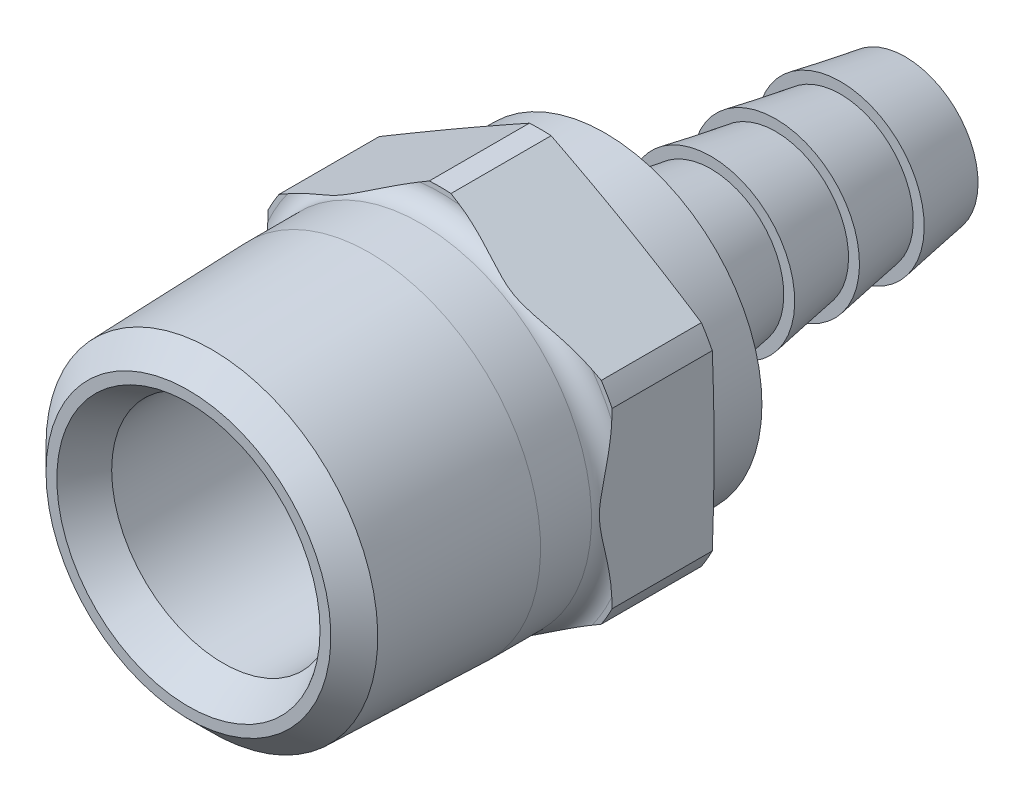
ISO-10303-21;
HEADER;
FILE_DESCRIPTION(('STEP AP214'),'2;1');
FILE_NAME('part.step','',(''),(''),'','','');
FILE_SCHEMA(('AUTOMOTIVE_DESIGN { 1 0 10303 214 1 1 1 1 }'));
ENDSEC;
DATA;
#1=APPLICATION_CONTEXT('core data for automotive mechanical design processes');
#2=APPLICATION_PROTOCOL_DEFINITION('international standard','automotive_design',2000,#1);
#3=PRODUCT_CONTEXT('',#1,'mechanical');
#4=PRODUCT('Part','Part','',(#3));
#5=PRODUCT_RELATED_PRODUCT_CATEGORY('part','',(#4));
#6=PRODUCT_DEFINITION_FORMATION('','',#4);
#7=PRODUCT_DEFINITION_CONTEXT('part definition',#1,'design');
#8=PRODUCT_DEFINITION('design','',#6,#7);
#9=PRODUCT_DEFINITION_SHAPE('','',#8);
#10=(LENGTH_UNIT() NAMED_UNIT(*) SI_UNIT(.MILLI.,.METRE.));
#11=(NAMED_UNIT(*) PLANE_ANGLE_UNIT() SI_UNIT($,.RADIAN.));
#12=(NAMED_UNIT(*) SI_UNIT($,.STERADIAN.) SOLID_ANGLE_UNIT());
#13=UNCERTAINTY_MEASURE_WITH_UNIT(LENGTH_MEASURE(1.E-05),#10,'distance_accuracy_value','');
#14=(GEOMETRIC_REPRESENTATION_CONTEXT(3) GLOBAL_UNCERTAINTY_ASSIGNED_CONTEXT((#13)) GLOBAL_UNIT_ASSIGNED_CONTEXT((#10,
#11,#12)) REPRESENTATION_CONTEXT('',''));
#15=CARTESIAN_POINT('',(0.,0.,0.));
#16=DIRECTION('',(0.,0.,1.));
#17=DIRECTION('',(1.,0.,0.));
#18=AXIS2_PLACEMENT_3D('',#15,#16,#17);
#19=CARTESIAN_POINT('',(0.,0.,-42.0069607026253));
#20=DIRECTION('',(0.,0.,-1.));
#21=DIRECTION('',(-1.,0.,0.));
#22=AXIS2_PLACEMENT_3D('',#19,#20,#21);
#23=PLANE('',#22);
#24=CARTESIAN_POINT('',(0.,0.,-42.0069607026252));
#25=DIRECTION('',(0.,0.,-1.));
#26=DIRECTION('',(-1.,0.,0.));
#27=AXIS2_PLACEMENT_3D('',#24,#25,#26);
#28=CIRCLE('',#27,5.1562);
#29=CARTESIAN_POINT('',(-5.1562,0.,-42.0069607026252));
#30=VERTEX_POINT('',#29);
#31=EDGE_CURVE('E10',#30,#30,#28,.F.);
#32=ORIENTED_EDGE('',*,*,#31,.T.);
#33=EDGE_LOOP('',(#32));
#34=FACE_BOUND('',#33,.T.);
#35=CARTESIAN_POINT('',(0.,0.,-42.0069607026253));
#36=DIRECTION('',(0.,0.,-1.));
#37=DIRECTION('',(0.,1.,0.));
#38=AXIS2_PLACEMENT_3D('',#35,#36,#37);
#39=CIRCLE('',#38,5.715);
#40=CARTESIAN_POINT('',(0.,5.715,-42.0069607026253));
#41=VERTEX_POINT('',#40);
#42=EDGE_CURVE('E584',#41,#41,#39,.T.);
#43=ORIENTED_EDGE('',*,*,#42,.T.);
#44=EDGE_LOOP('',(#43));
#45=FACE_BOUND('',#44,.T.);
#46=ADVANCED_FACE('F15',(#34,#45),#23,.T.);
#47=CARTESIAN_POINT('',(0.,0.,14.2286392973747));
#48=DIRECTION('',(0.,0.,-1.));
#49=DIRECTION('',(-1.,0.,0.));
#50=AXIS2_PLACEMENT_3D('',#47,#48,#49);
#51=CYLINDRICAL_SURFACE('',#50,15.113);
#52=CARTESIAN_POINT('',(0.,0.,-13.3752972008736));
#53=DIRECTION('',(0.,0.,1.));
#54=DIRECTION('',(0.,1.,0.));
#55=AXIS2_PLACEMENT_3D('',#52,#53,#54);
#56=CIRCLE('',#55,15.1129999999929);
#57=CARTESIAN_POINT('',(-12.6410339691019,-8.28293602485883,-13.3752972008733));
#58=VERTEX_POINT('',#57);
#59=CARTESIAN_POINT('',(-13.49375,-6.80598853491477,-13.3752972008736));
#60=VERTEX_POINT('',#59);
#61=EDGE_CURVE('E169',#58,#60,#56,.F.);
#62=ORIENTED_EDGE('',*,*,#61,.F.);
#63=DIRECTION('',(0.,0.,1.));
#64=VECTOR('',#63,1.);
#65=CARTESIAN_POINT('',(-12.6410339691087,-8.28293602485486,14.2286392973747));
#66=LINE('',#65,#64);
#67=CARTESIAN_POINT('',(-12.6410339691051,-8.28293602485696,-5.5212287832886));
#68=VERTEX_POINT('',#67);
#69=EDGE_CURVE('E161',#68,#58,#66,.F.);
#70=ORIENTED_EDGE('',*,*,#69,.F.);
#71=CARTESIAN_POINT('',(0.,0.,-5.52122878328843));
#72=DIRECTION('',(0.,0.,-1.));
#73=DIRECTION('',(0.,1.,0.));
#74=AXIS2_PLACEMENT_3D('',#71,#72,#73);
#75=CIRCLE('',#74,15.1129999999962);
#76=CARTESIAN_POINT('',(-13.49375,-6.80598853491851,-5.5212287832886));
#77=VERTEX_POINT('',#76);
#78=EDGE_CURVE('E197',#77,#68,#75,.F.);
#79=ORIENTED_EDGE('',*,*,#78,.F.);
#80=DIRECTION('',(0.,0.,1.));
#81=VECTOR('',#80,1.);
#82=CARTESIAN_POINT('',(-13.49375,-6.8059885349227,14.2286392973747));
#83=LINE('',#82,#81);
#84=EDGE_CURVE('E421',#60,#77,#83,.T.);
#85=ORIENTED_EDGE('',*,*,#84,.F.);
#86=EDGE_LOOP('',(#62,#70,#79,#85));
#87=FACE_BOUND('',#86,.T.);
#88=ADVANCED_FACE('F17',(#87),#51,.T.);
#89=CARTESIAN_POINT('',(0.,0.,14.2286392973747));
#90=DIRECTION('',(0.,0.,-1.));
#91=DIRECTION('',(-1.,0.,0.));
#92=AXIS2_PLACEMENT_3D('',#89,#90,#91);
#93=CYLINDRICAL_SURFACE('',#92,15.113);
#94=CARTESIAN_POINT('',(0.,0.,-13.3752972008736));
#95=DIRECTION('',(0.,0.,1.));
#96=DIRECTION('',(0.,1.,0.));
#97=AXIS2_PLACEMENT_3D('',#94,#95,#96);
#98=CIRCLE('',#97,15.1129999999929);
#99=CARTESIAN_POINT('',(-13.49375,6.80598853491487,-13.3752972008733));
#100=VERTEX_POINT('',#99);
#101=CARTESIAN_POINT('',(-12.6410339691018,8.28293602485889,-13.3752972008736));
#102=VERTEX_POINT('',#101);
#103=EDGE_CURVE('E145',#100,#102,#98,.F.);
#104=ORIENTED_EDGE('',*,*,#103,.F.);
#105=DIRECTION('',(0.,0.,1.));
#106=VECTOR('',#105,1.);
#107=CARTESIAN_POINT('',(-13.49375,6.80598853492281,14.2286392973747));
#108=LINE('',#107,#106);
#109=CARTESIAN_POINT('',(-13.49375,6.80598853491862,-5.5212287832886));
#110=VERTEX_POINT('',#109);
#111=EDGE_CURVE('E383',#110,#100,#108,.F.);
#112=ORIENTED_EDGE('',*,*,#111,.F.);
#113=CARTESIAN_POINT('',(0.,0.,-5.52122878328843));
#114=DIRECTION('',(0.,0.,-1.));
#115=DIRECTION('',(0.,1.,0.));
#116=AXIS2_PLACEMENT_3D('',#113,#114,#115);
#117=CIRCLE('',#116,15.1129999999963);
#118=CARTESIAN_POINT('',(-12.6410339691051,8.28293602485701,-5.5212287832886));
#119=VERTEX_POINT('',#118);
#120=EDGE_CURVE('E190',#119,#110,#117,.F.);
#121=ORIENTED_EDGE('',*,*,#120,.F.);
#122=DIRECTION('',(0.,0.,1.));
#123=VECTOR('',#122,1.);
#124=CARTESIAN_POINT('',(-12.6410339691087,8.28293602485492,14.2286392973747));
#125=LINE('',#124,#123);
#126=EDGE_CURVE('E324',#102,#119,#125,.T.);
#127=ORIENTED_EDGE('',*,*,#126,.F.);
#128=EDGE_LOOP('',(#104,#112,#121,#127));
#129=FACE_BOUND('',#128,.T.);
#130=ADVANCED_FACE('F501',(#129),#93,.T.);
#131=CARTESIAN_POINT('',(0.,0.,14.2286392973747));
#132=DIRECTION('',(0.,0.,-1.));
#133=DIRECTION('',(-1.,0.,0.));
#134=AXIS2_PLACEMENT_3D('',#131,#132,#133);
#135=CYLINDRICAL_SURFACE('',#134,15.113);
#136=CARTESIAN_POINT('',(0.,0.,-13.3752972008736));
#137=DIRECTION('',(0.,0.,1.));
#138=DIRECTION('',(0.,1.,0.));
#139=AXIS2_PLACEMENT_3D('',#136,#137,#138);
#140=CIRCLE('',#139,15.1129999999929);
#141=CARTESIAN_POINT('',(-0.852716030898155,15.0889245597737,-13.3752972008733));
#142=VERTEX_POINT('',#141);
#143=CARTESIAN_POINT('',(0.852716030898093,15.0889245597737,-13.3752972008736));
#144=VERTEX_POINT('',#143);
#145=EDGE_CURVE('E183',#142,#144,#140,.F.);
#146=ORIENTED_EDGE('',*,*,#145,.F.);
#147=DIRECTION('',(0.,0.,1.));
#148=VECTOR('',#147,1.);
#149=CARTESIAN_POINT('',(-0.852716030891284,15.0889245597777,14.2286392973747));
#150=LINE('',#149,#148);
#151=CARTESIAN_POINT('',(-0.852716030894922,15.0889245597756,-5.5212287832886));
#152=VERTEX_POINT('',#151);
#153=EDGE_CURVE('E193',#152,#142,#150,.F.);
#154=ORIENTED_EDGE('',*,*,#153,.F.);
#155=CARTESIAN_POINT('',(0.,0.,-5.52122878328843));
#156=DIRECTION('',(0.,0.,-1.));
#157=DIRECTION('',(0.,1.,0.));
#158=AXIS2_PLACEMENT_3D('',#155,#156,#157);
#159=CIRCLE('',#158,15.1129999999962);
#160=CARTESIAN_POINT('',(0.852716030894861,15.0889245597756,-5.5212287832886));
#161=VERTEX_POINT('',#160);
#162=EDGE_CURVE('E184',#161,#152,#159,.F.);
#163=ORIENTED_EDGE('',*,*,#162,.F.);
#164=DIRECTION('',(0.,0.,1.));
#165=VECTOR('',#164,1.);
#166=CARTESIAN_POINT('',(0.852716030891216,15.0889245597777,14.2286392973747));
#167=LINE('',#166,#165);
#168=EDGE_CURVE('E415',#144,#161,#167,.T.);
#169=ORIENTED_EDGE('',*,*,#168,.F.);
#170=EDGE_LOOP('',(#146,#154,#163,#169));
#171=FACE_BOUND('',#170,.T.);
#172=ADVANCED_FACE('F508',(#171),#135,.T.);
#173=CARTESIAN_POINT('',(0.,0.,14.2286392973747));
#174=DIRECTION('',(0.,0.,-1.));
#175=DIRECTION('',(-1.,0.,0.));
#176=AXIS2_PLACEMENT_3D('',#173,#174,#175);
#177=CYLINDRICAL_SURFACE('',#176,15.113);
#178=CARTESIAN_POINT('',(0.,0.,-13.3752972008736));
#179=DIRECTION('',(0.,0.,1.));
#180=DIRECTION('',(0.,1.,0.));
#181=AXIS2_PLACEMENT_3D('',#178,#179,#180);
#182=CIRCLE('',#181,15.1129999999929);
#183=CARTESIAN_POINT('',(12.6410339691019,8.28293602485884,-13.3752972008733));
#184=VERTEX_POINT('',#183);
#185=CARTESIAN_POINT('',(13.49375,6.8059885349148,-13.3752972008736));
#186=VERTEX_POINT('',#185);
#187=EDGE_CURVE('E172',#184,#186,#182,.F.);
#188=ORIENTED_EDGE('',*,*,#187,.F.);
#189=DIRECTION('',(0.,0.,1.));
#190=VECTOR('',#189,1.);
#191=CARTESIAN_POINT('',(12.6410339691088,8.28293602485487,14.2286392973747));
#192=LINE('',#191,#190);
#193=CARTESIAN_POINT('',(12.6410339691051,8.28293602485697,-5.5212287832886));
#194=VERTEX_POINT('',#193);
#195=EDGE_CURVE('E417',#194,#184,#192,.F.);
#196=ORIENTED_EDGE('',*,*,#195,.F.);
#197=CARTESIAN_POINT('',(0.,0.,-5.52122878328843));
#198=DIRECTION('',(0.,0.,-1.));
#199=DIRECTION('',(0.,1.,0.));
#200=AXIS2_PLACEMENT_3D('',#197,#198,#199);
#201=CIRCLE('',#200,15.1129999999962);
#202=CARTESIAN_POINT('',(13.49375,6.80598853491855,-5.5212287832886));
#203=VERTEX_POINT('',#202);
#204=EDGE_CURVE('E178',#203,#194,#201,.F.);
#205=ORIENTED_EDGE('',*,*,#204,.F.);
#206=DIRECTION('',(0.,0.,1.));
#207=VECTOR('',#206,1.);
#208=CARTESIAN_POINT('',(13.49375,6.80598853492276,14.2286392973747));
#209=LINE('',#208,#207);
#210=EDGE_CURVE('E411',#186,#203,#209,.T.);
#211=ORIENTED_EDGE('',*,*,#210,.F.);
#212=EDGE_LOOP('',(#188,#196,#205,#211));
#213=FACE_BOUND('',#212,.T.);
#214=ADVANCED_FACE('F510',(#213),#177,.T.);
#215=CARTESIAN_POINT('',(0.,0.,14.2286392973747));
#216=DIRECTION('',(0.,0.,-1.));
#217=DIRECTION('',(-1.,0.,0.));
#218=AXIS2_PLACEMENT_3D('',#215,#216,#217);
#219=CYLINDRICAL_SURFACE('',#218,15.113);
#220=CARTESIAN_POINT('',(0.,0.,-13.3752972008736));
#221=DIRECTION('',(0.,0.,1.));
#222=DIRECTION('',(0.,1.,0.));
#223=AXIS2_PLACEMENT_3D('',#220,#221,#222);
#224=CIRCLE('',#223,15.1129999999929);
#225=CARTESIAN_POINT('',(0.852716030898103,-15.0889245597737,-13.3752972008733));
#226=VERTEX_POINT('',#225);
#227=CARTESIAN_POINT('',(-0.852716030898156,-15.0889245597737,-13.3752972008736));
#228=VERTEX_POINT('',#227);
#229=EDGE_CURVE('E167',#226,#228,#224,.F.);
#230=ORIENTED_EDGE('',*,*,#229,.F.);
#231=DIRECTION('',(0.,0.,1.));
#232=VECTOR('',#231,1.);
#233=CARTESIAN_POINT('',(0.852716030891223,-15.0889245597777,14.2286392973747));
#234=LINE('',#233,#232);
#235=CARTESIAN_POINT('',(0.85271603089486,-15.0889245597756,-5.52122878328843));
#236=VERTEX_POINT('',#235);
#237=EDGE_CURVE('E140',#236,#226,#234,.F.);
#238=ORIENTED_EDGE('',*,*,#237,.F.);
#239=CARTESIAN_POINT('',(0.,0.,-5.52122878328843));
#240=DIRECTION('',(0.,0.,-1.));
#241=DIRECTION('',(0.,1.,0.));
#242=AXIS2_PLACEMENT_3D('',#239,#240,#241);
#243=CIRCLE('',#242,15.1129999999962);
#244=CARTESIAN_POINT('',(-0.852716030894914,-15.0889245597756,-5.5212287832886));
#245=VERTEX_POINT('',#244);
#246=EDGE_CURVE('E133',#245,#236,#243,.F.);
#247=ORIENTED_EDGE('',*,*,#246,.F.);
#248=DIRECTION('',(0.,0.,1.));
#249=VECTOR('',#248,1.);
#250=CARTESIAN_POINT('',(-0.852716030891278,-15.0889245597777,14.2286392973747));
#251=LINE('',#250,#249);
#252=EDGE_CURVE('E137',#228,#245,#251,.T.);
#253=ORIENTED_EDGE('',*,*,#252,.F.);
#254=EDGE_LOOP('',(#230,#238,#247,#253));
#255=FACE_BOUND('',#254,.T.);
#256=ADVANCED_FACE('F136',(#255),#219,.T.);
#257=CARTESIAN_POINT('',(0.,0.,14.2286392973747));
#258=DIRECTION('',(0.,0.,-1.));
#259=DIRECTION('',(-1.,0.,0.));
#260=AXIS2_PLACEMENT_3D('',#257,#258,#259);
#261=CYLINDRICAL_SURFACE('',#260,15.113);
#262=CARTESIAN_POINT('',(0.,0.,-13.3752972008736));
#263=DIRECTION('',(0.,0.,1.));
#264=DIRECTION('',(0.,1.,0.));
#265=AXIS2_PLACEMENT_3D('',#262,#263,#264);
#266=CIRCLE('',#265,15.1129999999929);
#267=CARTESIAN_POINT('',(13.49375,-6.80598853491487,-13.3752972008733));
#268=VERTEX_POINT('',#267);
#269=CARTESIAN_POINT('',(12.6410339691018,-8.28293602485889,-13.3752972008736));
#270=VERTEX_POINT('',#269);
#271=EDGE_CURVE('E170',#268,#270,#266,.F.);
#272=ORIENTED_EDGE('',*,*,#271,.F.);
#273=DIRECTION('',(0.,0.,1.));
#274=VECTOR('',#273,1.);
#275=CARTESIAN_POINT('',(13.49375,-6.80598853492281,14.2286392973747));
#276=LINE('',#275,#274);
#277=CARTESIAN_POINT('',(13.49375,-6.8059885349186,-5.5212287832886));
#278=VERTEX_POINT('',#277);
#279=EDGE_CURVE('E413',#278,#268,#276,.F.);
#280=ORIENTED_EDGE('',*,*,#279,.F.);
#281=CARTESIAN_POINT('',(0.,0.,-5.52122878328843));
#282=DIRECTION('',(0.,0.,-1.));
#283=DIRECTION('',(0.,1.,0.));
#284=AXIS2_PLACEMENT_3D('',#281,#282,#283);
#285=CIRCLE('',#284,15.1129999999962);
#286=CARTESIAN_POINT('',(12.6410339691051,-8.28293602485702,-5.5212287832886));
#287=VERTEX_POINT('',#286);
#288=EDGE_CURVE('E174',#287,#278,#285,.F.);
#289=ORIENTED_EDGE('',*,*,#288,.F.);
#290=DIRECTION('',(0.,0.,1.));
#291=VECTOR('',#290,1.);
#292=CARTESIAN_POINT('',(12.6410339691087,-8.28293602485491,14.2286392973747));
#293=LINE('',#292,#291);
#294=EDGE_CURVE('E402',#270,#287,#293,.T.);
#295=ORIENTED_EDGE('',*,*,#294,.F.);
#296=EDGE_LOOP('',(#272,#280,#289,#295));
#297=FACE_BOUND('',#296,.T.);
#298=ADVANCED_FACE('F285',(#297),#261,.T.);
#299=CARTESIAN_POINT('',(0.,0.,-13.3752972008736));
#300=DIRECTION('',(0.,0.,1.));
#301=DIRECTION('',(1.,0.,0.));
#302=AXIS2_PLACEMENT_3D('',#299,#300,#301);
#303=CONICAL_SURFACE('',#302,15.1129999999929,1.4835298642);
#304=CARTESIAN_POINT('',(0.,0.,-14.0365326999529));
#305=DIRECTION('',(0.,0.,1.));
#306=DIRECTION('',(1.,0.,0.));
#307=AXIS2_PLACEMENT_3D('',#304,#305,#306);
#308=CIRCLE('',#307,7.55504366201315);
#309=CARTESIAN_POINT('',(7.55504366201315,0.,-14.0365326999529));
#310=VERTEX_POINT('',#309);
#311=EDGE_CURVE('E399',#310,#310,#308,.T.);
#312=ORIENTED_EDGE('',*,*,#311,.T.);
#313=EDGE_LOOP('',(#312));
#314=FACE_BOUND('',#313,.T.);
#315=ORIENTED_EDGE('',*,*,#103,.T.);
#316=CARTESIAN_POINT('',(-0.852716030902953,15.0889245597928,-13.3752972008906));
#317=CARTESIAN_POINT('',(-1.34374904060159,14.8054265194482,-13.3976506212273));
#318=CARTESIAN_POINT('',(-1.8348640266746,14.5218811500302,-13.4177576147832));
#319=CARTESIAN_POINT('',(-2.81724267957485,13.9547045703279,-13.4528640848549));
#320=CARTESIAN_POINT('',(-3.30850634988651,13.6710733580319,-13.4678634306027));
#321=CARTESIAN_POINT('',(-4.2909277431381,13.1038721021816,-13.492133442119));
#322=CARTESIAN_POINT('',(-4.78208541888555,12.8203020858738,-13.5014066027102));
#323=CARTESIAN_POINT('',(-5.76445373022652,12.2531314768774,-13.5138214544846));
#324=CARTESIAN_POINT('',(-6.25566436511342,11.9695308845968,-13.5169632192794));
#325=CARTESIAN_POINT('',(-7.2380856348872,11.4023297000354,-13.5169632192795));
#326=CARTESIAN_POINT('',(-7.72929626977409,11.1187291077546,-13.5138214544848));
#327=CARTESIAN_POINT('',(-8.71166458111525,10.5515584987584,-13.5014066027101));
#328=CARTESIAN_POINT('',(-9.20282225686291,10.2679884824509,-13.4921334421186));
#329=CARTESIAN_POINT('',(-10.1852436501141,9.7007872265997,-13.4678634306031));
#330=CARTESIAN_POINT('',(-10.6765073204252,9.41715601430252,-13.4528640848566));
#331=CARTESIAN_POINT('',(-11.6588859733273,8.84997943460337,-13.4177576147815));
#332=CARTESIAN_POINT('',(-12.1500009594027,8.56643406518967,-13.397650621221));
#333=CARTESIAN_POINT('',(-12.6410339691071,8.28293602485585,-13.375297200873));
#334=B_SPLINE_CURVE_WITH_KNOTS('',3,(#316,#317,#318,#319,#320,#321,#322,#323,#324,#325,#326,
#327,#328,#329,#330,#331,#332,#333),.UNSPECIFIED.,.F.,.F.,(4,2,2,2,2,2,2,2,4),(0.,
1.70231432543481,3.40467223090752,5.10628791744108,6.80788317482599,8.50947843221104,
10.2110941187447,11.9134520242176,13.6157663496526),.UNSPECIFIED.);
#335=EDGE_CURVE('E317',#142,#102,#334,.T.);
#336=ORIENTED_EDGE('',*,*,#335,.F.);
#337=ORIENTED_EDGE('',*,*,#145,.T.);
#338=CARTESIAN_POINT('',(12.641033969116,8.28293602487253,-13.3752972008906));
#339=CARTESIAN_POINT('',(12.1500009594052,8.56643406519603,-13.3976506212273));
#340=CARTESIAN_POINT('',(11.6588859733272,8.84997943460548,-13.4177576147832));
#341=CARTESIAN_POINT('',(10.6765073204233,9.41715601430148,-13.4528640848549));
#342=CARTESIAN_POINT('',(10.185243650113,9.70078722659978,-13.4678634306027));
#343=CARTESIAN_POINT('',(9.20282225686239,10.2679884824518,-13.492133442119));
#344=CARTESIAN_POINT('',(8.71166458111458,10.5515584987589,-13.5014066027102));
#345=CARTESIAN_POINT('',(7.72929626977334,11.1187291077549,-13.5138214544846));
#346=CARTESIAN_POINT('',(7.23808563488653,11.4023297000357,-13.5169632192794));
#347=CARTESIAN_POINT('',(6.25566436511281,11.9695308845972,-13.5169632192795));
#348=CARTESIAN_POINT('',(5.7644537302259,12.253131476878,-13.5138214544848));
#349=CARTESIAN_POINT('',(4.78208541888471,12.8203020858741,-13.5014066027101));
#350=CARTESIAN_POINT('',(4.29092774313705,13.1038721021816,-13.4921334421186));
#351=CARTESIAN_POINT('',(3.30850634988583,13.6710733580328,-13.4678634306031));
#352=CARTESIAN_POINT('',(2.81724267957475,13.95470457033,-13.4528640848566));
#353=CARTESIAN_POINT('',(1.83486402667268,14.5218811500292,-13.4177576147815));
#354=CARTESIAN_POINT('',(1.34374904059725,14.8054265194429,-13.397650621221));
#355=CARTESIAN_POINT('',(0.852716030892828,15.0889245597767,-13.375297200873));
#356=B_SPLINE_CURVE_WITH_KNOTS('',3,(#338,#339,#340,#341,#342,#343,#344,#345,#346,#347,#348,
#349,#350,#351,#352,#353,#354,#355),.UNSPECIFIED.,.F.,.F.,(4,2,2,2,2,2,2,2,4),(0.,
1.70231432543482,3.40467223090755,5.10628791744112,6.80788317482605,8.50947843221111,
10.2110941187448,11.9134520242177,13.6157663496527),.UNSPECIFIED.);
#357=EDGE_CURVE('E309',#184,#144,#356,.T.);
#358=ORIENTED_EDGE('',*,*,#357,.F.);
#359=ORIENTED_EDGE('',*,*,#187,.T.);
#360=CARTESIAN_POINT('',(13.4937500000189,-6.80598853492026,-13.3752972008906));
#361=CARTESIAN_POINT('',(13.4937500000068,-6.23899245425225,-13.3976506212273));
#362=CARTESIAN_POINT('',(13.4937500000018,-5.67190171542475,-13.4177576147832));
#363=CARTESIAN_POINT('',(13.4937499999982,-4.53754855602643,-13.4528640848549));
#364=CARTESIAN_POINT('',(13.4937499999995,-3.97028613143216,-13.4678634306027));
#365=CARTESIAN_POINT('',(13.4937500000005,-2.8358836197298,-13.492133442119));
#366=CARTESIAN_POINT('',(13.4937500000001,-2.26874358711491,-13.5014066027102));
#367=CARTESIAN_POINT('',(13.4937499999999,-1.13440236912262,-13.5138214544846));
#368=CARTESIAN_POINT('',(13.49375,-0.567201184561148,-13.5169632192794));
#369=CARTESIAN_POINT('',(13.4937500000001,0.567201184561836,-13.5169632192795));
#370=CARTESIAN_POINT('',(13.49375,1.13440236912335,-13.5138214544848));
#371=CARTESIAN_POINT('',(13.49375,2.26874358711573,-13.5014066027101));
#372=CARTESIAN_POINT('',(13.49375,2.83588361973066,-13.4921334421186));
#373=CARTESIAN_POINT('',(13.49375,3.97028613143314,-13.4678634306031));
#374=CARTESIAN_POINT('',(13.49375,4.53754855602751,-13.4528640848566));
#375=CARTESIAN_POINT('',(13.49375,5.67190171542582,-13.4177576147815));
#376=CARTESIAN_POINT('',(13.49375,6.23899245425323,-13.397650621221));
#377=CARTESIAN_POINT('',(13.49375,6.8059885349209,-13.375297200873));
#378=B_SPLINE_CURVE_WITH_KNOTS('',3,(#360,#361,#362,#363,#364,#365,#366,#367,#368,#369,#370,
#371,#372,#373,#374,#375,#376,#377),.UNSPECIFIED.,.F.,.F.,(4,2,2,2,2,2,2,2,4),(0.,
1.70231432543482,3.40467223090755,5.10628791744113,6.80788317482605,8.50947843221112,
10.2110941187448,11.9134520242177,13.6157663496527),.UNSPECIFIED.);
#379=EDGE_CURVE('E302',#268,#186,#378,.T.);
#380=ORIENTED_EDGE('',*,*,#379,.F.);
#381=ORIENTED_EDGE('',*,*,#271,.T.);
#382=CARTESIAN_POINT('',(0.85271603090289,-15.0889245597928,-13.3752972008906));
#383=CARTESIAN_POINT('',(1.34374904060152,-14.8054265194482,-13.3976506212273));
#384=CARTESIAN_POINT('',(1.83486402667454,-14.5218811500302,-13.4177576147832));
#385=CARTESIAN_POINT('',(2.8172426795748,-13.9547045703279,-13.4528640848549));
#386=CARTESIAN_POINT('',(3.30850634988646,-13.6710733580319,-13.4678634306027));
#387=CARTESIAN_POINT('',(4.29092774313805,-13.1038721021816,-13.492133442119));
#388=CARTESIAN_POINT('',(4.78208541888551,-12.8203020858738,-13.5014066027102));
#389=CARTESIAN_POINT('',(5.76445373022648,-12.2531314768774,-13.5138214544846));
#390=CARTESIAN_POINT('',(6.25566436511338,-11.9695308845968,-13.5169632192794));
#391=CARTESIAN_POINT('',(7.23808563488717,-11.4023297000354,-13.5169632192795));
#392=CARTESIAN_POINT('',(7.72929626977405,-11.1187291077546,-13.5138214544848));
#393=CARTESIAN_POINT('',(8.71166458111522,-10.5515584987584,-13.5014066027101));
#394=CARTESIAN_POINT('',(9.20282225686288,-10.2679884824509,-13.4921334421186));
#395=CARTESIAN_POINT('',(10.1852436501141,-9.70078722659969,-13.4678634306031));
#396=CARTESIAN_POINT('',(10.6765073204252,-9.4171560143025,-13.4528640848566));
#397=CARTESIAN_POINT('',(11.6588859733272,-8.84997943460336,-13.4177576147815));
#398=CARTESIAN_POINT('',(12.1500009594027,-8.56643406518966,-13.397650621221));
#399=CARTESIAN_POINT('',(12.6410339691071,-8.28293602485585,-13.375297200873));
#400=B_SPLINE_CURVE_WITH_KNOTS('',3,(#382,#383,#384,#385,#386,#387,#388,#389,#390,#391,#392,
#393,#394,#395,#396,#397,#398,#399),.UNSPECIFIED.,.F.,.F.,(4,2,2,2,2,2,2,2,4),(0.,
1.70231432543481,3.40467223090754,5.1062879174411,6.80788317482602,8.50947843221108,
10.2110941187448,11.9134520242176,13.6157663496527),.UNSPECIFIED.);
#401=EDGE_CURVE('E261',#226,#270,#400,.T.);
#402=ORIENTED_EDGE('',*,*,#401,.F.);
#403=ORIENTED_EDGE('',*,*,#229,.T.);
#404=CARTESIAN_POINT('',(-12.641033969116,-8.28293602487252,-13.3752972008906));
#405=CARTESIAN_POINT('',(-12.1500009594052,-8.56643406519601,-13.3976506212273));
#406=CARTESIAN_POINT('',(-11.6588859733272,-8.84997943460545,-13.4177576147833));
#407=CARTESIAN_POINT('',(-10.6765073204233,-9.41715601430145,-13.4528640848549));
#408=CARTESIAN_POINT('',(-10.185243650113,-9.70078722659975,-13.4678634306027));
#409=CARTESIAN_POINT('',(-9.20282225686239,-10.2679884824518,-13.492133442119));
#410=CARTESIAN_POINT('',(-8.71166458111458,-10.5515584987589,-13.5014066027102));
#411=CARTESIAN_POINT('',(-7.72929626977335,-11.1187291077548,-13.5138214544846));
#412=CARTESIAN_POINT('',(-7.23808563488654,-11.4023297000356,-13.5169632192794));
#413=CARTESIAN_POINT('',(-6.25566436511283,-11.9695308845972,-13.5169632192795));
#414=CARTESIAN_POINT('',(-5.76445373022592,-12.2531314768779,-13.5138214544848));
#415=CARTESIAN_POINT('',(-4.78208541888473,-12.8203020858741,-13.5014066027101));
#416=CARTESIAN_POINT('',(-4.29092774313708,-13.1038721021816,-13.4921334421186));
#417=CARTESIAN_POINT('',(-3.30850634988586,-13.6710733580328,-13.4678634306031));
#418=CARTESIAN_POINT('',(-2.81724267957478,-13.95470457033,-13.4528640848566));
#419=CARTESIAN_POINT('',(-1.83486402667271,-14.5218811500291,-13.4177576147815));
#420=CARTESIAN_POINT('',(-1.34374904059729,-14.8054265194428,-13.397650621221));
#421=CARTESIAN_POINT('',(-0.85271603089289,-15.0889245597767,-13.375297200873));
#422=B_SPLINE_CURVE_WITH_KNOTS('',3,(#404,#405,#406,#407,#408,#409,#410,#411,#412,#413,#414,
#415,#416,#417,#418,#419,#420,#421),.UNSPECIFIED.,.F.,.F.,(4,2,2,2,2,2,2,2,4),(0.,
1.70231432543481,3.40467223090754,5.1062879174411,6.80788317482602,8.50947843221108,
10.2110941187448,11.9134520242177,13.6157663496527),.UNSPECIFIED.);
#423=EDGE_CURVE('E154',#58,#228,#422,.T.);
#424=ORIENTED_EDGE('',*,*,#423,.F.);
#425=ORIENTED_EDGE('',*,*,#61,.T.);
#426=CARTESIAN_POINT('',(-13.4937500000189,6.80598853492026,-13.3752972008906));
#427=CARTESIAN_POINT('',(-13.4937500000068,6.23899245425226,-13.3976506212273));
#428=CARTESIAN_POINT('',(-13.4937500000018,5.67190171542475,-13.4177576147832));
#429=CARTESIAN_POINT('',(-13.4937499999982,4.53754855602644,-13.4528640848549));
#430=CARTESIAN_POINT('',(-13.4937499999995,3.97028613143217,-13.4678634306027));
#431=CARTESIAN_POINT('',(-13.4937500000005,2.83588361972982,-13.492133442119));
#432=CARTESIAN_POINT('',(-13.4937500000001,2.26874358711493,-13.5014066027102));
#433=CARTESIAN_POINT('',(-13.4937499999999,1.13440236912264,-13.5138214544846));
#434=CARTESIAN_POINT('',(-13.49375,0.567201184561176,-13.5169632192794));
#435=CARTESIAN_POINT('',(-13.4937500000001,-0.567201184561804,-13.5169632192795));
#436=CARTESIAN_POINT('',(-13.49375,-1.13440236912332,-13.5138214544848));
#437=CARTESIAN_POINT('',(-13.49375,-2.26874358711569,-13.5014066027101));
#438=CARTESIAN_POINT('',(-13.49375,-2.83588361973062,-13.4921334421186));
#439=CARTESIAN_POINT('',(-13.49375,-3.97028613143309,-13.4678634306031));
#440=CARTESIAN_POINT('',(-13.49375,-4.53754855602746,-13.4528640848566));
#441=CARTESIAN_POINT('',(-13.49375,-5.67190171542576,-13.4177576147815));
#442=CARTESIAN_POINT('',(-13.49375,-6.23899245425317,-13.397650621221));
#443=CARTESIAN_POINT('',(-13.49375,-6.80598853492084,-13.375297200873));
#444=B_SPLINE_CURVE_WITH_KNOTS('',3,(#426,#427,#428,#429,#430,#431,#432,#433,#434,#435,#436,
#437,#438,#439,#440,#441,#442,#443),.UNSPECIFIED.,.F.,.F.,(4,2,2,2,2,2,2,2,4),(0.,
1.70231432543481,3.40467223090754,5.1062879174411,6.80788317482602,8.50947843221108,
10.2110941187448,11.9134520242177,13.6157663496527),.UNSPECIFIED.);
#445=EDGE_CURVE('E291',#100,#60,#444,.T.);
#446=ORIENTED_EDGE('',*,*,#445,.F.);
#447=EDGE_LOOP('',(#315,#336,#337,#358,#359,#380,#381,#402,#403,#424,#425,#446));
#448=FACE_BOUND('',#447,.T.);
#449=ADVANCED_FACE('F278',(#314,#448),#303,.T.);
#450=CARTESIAN_POINT('',(0.,0.,-5.52122878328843));
#451=DIRECTION('',(0.,0.,-1.));
#452=DIRECTION('',(-1.,0.,0.));
#453=AXIS2_PLACEMENT_3D('',#450,#451,#452);
#454=CONICAL_SURFACE('',#453,15.1129999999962,1.4835298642);
#455=CARTESIAN_POINT('',(-0.852716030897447,-15.0889245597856,-5.52122878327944));
#456=CARTESIAN_POINT('',(-0.968441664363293,-15.0221103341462,-5.51596090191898));
#457=CARTESIAN_POINT('',(-1.08417145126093,-14.9552937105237,-5.51082089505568));
#458=CARTESIAN_POINT('',(-1.31563933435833,-14.8216556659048,-5.5007966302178));
#459=CARTESIAN_POINT('',(-1.43137743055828,-14.7548342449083,-5.4959123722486));
#460=CARTESIAN_POINT('',(-1.54711968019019,-14.6880104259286,-5.49115598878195));
#461=B_SPLINE_CURVE_WITH_KNOTS('',3,(#455,#456,#457,#458,#459,#460),.UNSPECIFIED.,.F.,.F.,(4,2,
4),(0.,0.401196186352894,0.802392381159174),.UNSPECIFIED.);
#462=CARTESIAN_POINT('',(-1.54711968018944,-14.6880104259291,-5.49115598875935));
#463=VERTEX_POINT('',#462);
#464=EDGE_CURVE('E19',#245,#463,#461,.T.);
#465=ORIENTED_EDGE('',*,*,#464,.F.);
#466=ORIENTED_EDGE('',*,*,#246,.T.);
#467=CARTESIAN_POINT('',(1.54711968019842,-14.6880104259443,-5.49115598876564));
#468=CARTESIAN_POINT('',(1.43137743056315,-14.7548342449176,-5.49591237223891));
#469=CARTESIAN_POINT('',(1.31563933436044,-14.8216556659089,-5.50079663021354));
#470=CARTESIAN_POINT('',(1.0841714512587,-14.9552937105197,-5.51082089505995));
#471=CARTESIAN_POINT('',(0.968441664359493,-15.0221103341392,-5.51596090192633));
#472=CARTESIAN_POINT('',(0.852716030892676,-15.0889245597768,-5.52122878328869));
#473=B_SPLINE_CURVE_WITH_KNOTS('',3,(#467,#468,#469,#470,#471,#472),.UNSPECIFIED.,.F.,.F.,(4,2,
4),(0.,0.40119619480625,0.80239238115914),.UNSPECIFIED.);
#474=CARTESIAN_POINT('',(1.5471196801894,-14.6880104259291,-5.49115598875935));
#475=VERTEX_POINT('',#474);
#476=EDGE_CURVE('E268',#475,#236,#473,.T.);
#477=ORIENTED_EDGE('',*,*,#476,.F.);
#478=CARTESIAN_POINT('',(0.,0.,-5.49115598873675));
#479=DIRECTION('',(0.,0.,-1.));
#480=DIRECTION('',(-1.,0.,0.));
#481=AXIS2_PLACEMENT_3D('',#478,#479,#480);
#482=CIRCLE('',#481,14.7692663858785);
#483=EDGE_CURVE('E160',#475,#463,#482,.T.);
#484=ORIENTED_EDGE('',*,*,#483,.T.);
#485=EDGE_LOOP('',(#465,#466,#477,#484));
#486=FACE_BOUND('',#485,.T.);
#487=ADVANCED_FACE('F158',(#486),#454,.T.);
#488=CARTESIAN_POINT('',(-13.49375,-7.79062019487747,14.2286392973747));
#489=DIRECTION('',(-0.5,-0.866025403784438,0.));
#490=DIRECTION('',(0.866025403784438,-0.5,0.));
#491=AXIS2_PLACEMENT_3D('',#488,#489,#490);
#492=PLANE('',#491);
#493=ORIENTED_EDGE('',*,*,#423,.T.);
#494=ORIENTED_EDGE('',*,*,#252,.T.);
#495=ORIENTED_EDGE('',*,*,#464,.T.);
#496=CARTESIAN_POINT('',(-1.54711968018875,-14.6880104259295,-5.49115598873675));
#497=CARTESIAN_POINT('',(-1.65551566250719,-14.6254279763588,-5.48668906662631));
#498=CARTESIAN_POINT('',(-1.76381548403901,-14.5629010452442,-5.47975452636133));
#499=CARTESIAN_POINT('',(-1.97998087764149,-14.4380978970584,-5.46155584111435));
#500=CARTESIAN_POINT('',(-2.08784685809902,-14.3758214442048,-5.4502982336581));
#501=CARTESIAN_POINT('',(-2.30316724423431,-14.2515061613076,-5.42404962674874));
#502=CARTESIAN_POINT('',(-2.41062185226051,-14.189467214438,-5.40906079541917));
#503=CARTESIAN_POINT('',(-2.62514806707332,-14.0656104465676,-5.37585049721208));
#504=CARTESIAN_POINT('',(-2.7322196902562,-14.0037926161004,-5.35762917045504));
#505=CARTESIAN_POINT('',(-2.94763332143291,-13.8794234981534,-5.31811609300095));
#506=CARTESIAN_POINT('',(-3.05596934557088,-13.8168756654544,-5.29678118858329));
#507=CARTESIAN_POINT('',(-3.27228879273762,-13.6919835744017,-5.2517112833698));
#508=CARTESIAN_POINT('',(-3.38027213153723,-13.6296393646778,-5.22797574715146));
#509=CARTESIAN_POINT('',(-3.59590366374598,-13.5051444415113,-5.17855667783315));
#510=CARTESIAN_POINT('',(-3.70355185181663,-13.4429937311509,-5.15287311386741));
#511=CARTESIAN_POINT('',(-3.91853304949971,-13.3188742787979,-5.10002601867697));
#512=CARTESIAN_POINT('',(-4.02586615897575,-13.256905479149,-5.07286302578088));
#513=CARTESIAN_POINT('',(-4.23156022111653,-13.1381479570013,-5.01980765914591));
#514=CARTESIAN_POINT('',(-4.32993636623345,-13.0813504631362,-4.99399330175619));
#515=CARTESIAN_POINT('',(-4.52660474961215,-12.9678039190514,-4.94196448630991));
#516=CARTESIAN_POINT('',(-4.62489699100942,-12.9110548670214,-4.91575004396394));
#517=CARTESIAN_POINT('',(-4.82157285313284,-12.7975040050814,-4.8634258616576));
#518=CARTESIAN_POINT('',(-4.9199564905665,-12.7407021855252,-4.83731620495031));
#519=CARTESIAN_POINT('',(-5.11701955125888,-12.6269277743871,-4.78584765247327));
#520=CARTESIAN_POINT('',(-5.21569919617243,-12.5699550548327,-4.76048987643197));
#521=CARTESIAN_POINT('',(-5.41159190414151,-12.4568563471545,-4.71189023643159));
#522=CARTESIAN_POINT('',(-5.50879932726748,-12.4007336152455,-4.68861846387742));
#523=CARTESIAN_POINT('',(-5.70364494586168,-12.2882394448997,-4.64482635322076));
#524=CARTESIAN_POINT('',(-5.80128294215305,-12.2318681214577,-4.62430485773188));
#525=CARTESIAN_POINT('',(-5.99697011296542,-12.1188880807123,-4.58751173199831));
#526=CARTESIAN_POINT('',(-6.09501804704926,-12.0622800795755,-4.57123154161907));
#527=CARTESIAN_POINT('',(-6.29153689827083,-11.9488198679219,-4.54462482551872));
#528=CARTESIAN_POINT('',(-6.39000646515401,-11.8919684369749,-4.53428566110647));
#529=CARTESIAN_POINT('',(-6.55592154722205,-11.7961773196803,-4.52309386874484));
#530=CARTESIAN_POINT('',(-6.62326761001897,-11.7572950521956,-4.52026937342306));
#531=CARTESIAN_POINT('',(-6.75800327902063,-11.679505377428,-4.5182559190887));
#532=CARTESIAN_POINT('',(-6.82539288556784,-11.6405979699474,-4.51906698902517));
#533=CARTESIAN_POINT('',(-6.96021890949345,-11.5627561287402,-4.52426813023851));
#534=CARTESIAN_POINT('',(-7.02765508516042,-11.5238218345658,-4.52866633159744));
#535=CARTESIAN_POINT('',(-7.16230638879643,-11.4460808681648,-4.54071836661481));
#536=CARTESIAN_POINT('',(-7.22952150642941,-11.4072742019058,-4.54837235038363));
#537=CARTESIAN_POINT('',(-7.4309227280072,-11.2909951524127,-4.57549292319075));
#538=CARTESIAN_POINT('',(-7.56468419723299,-11.213767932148,-4.59910875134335));
#539=CARTESIAN_POINT('',(-7.8336579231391,-11.0584758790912,-4.65360857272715));
#540=CARTESIAN_POINT('',(-7.96884901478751,-10.9804232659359,-4.68462290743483));
#541=CARTESIAN_POINT('',(-8.23841447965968,-10.8247895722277,-4.75017750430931));
#542=CARTESIAN_POINT('',(-8.37278960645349,-10.7472080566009,-4.78471371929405));
#543=CARTESIAN_POINT('',(-8.64127998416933,-10.5921950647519,-4.85507480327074));
#544=CARTESIAN_POINT('',(-8.77539523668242,-10.5147635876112,-4.89089966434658));
#545=CARTESIAN_POINT('',(-9.03638420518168,-10.3640815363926,-4.96033703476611));
#546=CARTESIAN_POINT('',(-9.16325500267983,-10.2908326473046,-4.99396388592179));
#547=CARTESIAN_POINT('',(-9.41726118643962,-10.144182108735,-5.05998778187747));
#548=CARTESIAN_POINT('',(-9.54439661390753,-10.0707804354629,-5.09238461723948));
#549=CARTESIAN_POINT('',(-9.79902268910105,-9.92377200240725,-5.15510212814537));
#550=CARTESIAN_POINT('',(-9.9265132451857,-9.85016529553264,-5.18542329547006));
#551=CARTESIAN_POINT('',(-10.1819248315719,-9.70270334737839,-5.24322755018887));
#552=CARTESIAN_POINT('',(-10.3098456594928,-9.6288482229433,-5.2707118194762));
#553=CARTESIAN_POINT('',(-10.5626209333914,-9.4829083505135,-5.32138928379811));
#554=CARTESIAN_POINT('',(-10.6874603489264,-9.41083228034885,-5.34468148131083));
#555=CARTESIAN_POINT('',(-10.9376795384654,-9.26636816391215,-5.3871838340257));
#556=CARTESIAN_POINT('',(-11.06305937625,-9.19398008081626,-5.40639349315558));
#557=CARTESIAN_POINT('',(-11.314437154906,-9.04884705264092,-5.43997398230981));
#558=CARTESIAN_POINT('',(-11.4404355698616,-8.97610183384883,-5.45434019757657));
#559=CARTESIAN_POINT('',(-11.6931189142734,-8.83021503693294,-5.47732016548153));
#560=CARTESIAN_POINT('',(-11.8198047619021,-8.75707292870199,-5.48592027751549));
#561=CARTESIAN_POINT('',(-11.9466303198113,-8.68385015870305,-5.49115598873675));
#562=B_SPLINE_CURVE_WITH_KNOTS('',3,(#496,#497,#498,#499,#500,#501,#502,#503,#504,#505,#506,
#507,#508,#509,#510,#511,#512,#513,#514,#515,#516,#517,#518,#519,#520,#521,#522,#523,#524,#525,
#526,#527,#528,#529,#530,#531,#532,#533,#534,#535,#536,#537,#538,#539,#540,#541,#542,#543,#544,
#545,#546,#547,#548,#549,#550,#551,#552,#553,#554,#555,#556,#557,#558,#559,#560,#561),
.UNSPECIFIED.,.F.,.F.,(4,2,2,2,2,2,2,2,2,2,2,2,2,2,2,2,2,2,2,2,2,2,2,2,2,2,2,2,2,2,2,2,4),(0.,
0.375676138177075,0.750786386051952,1.1256791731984,1.50055571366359,1.88123383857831,
2.26199705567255,2.64276630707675,3.02339791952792,3.3728700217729,3.7223284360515,
4.07202431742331,4.42221719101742,4.76609549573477,5.10982863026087,5.45286254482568,
5.79516397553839,6.02853276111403,6.26190340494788,6.49580444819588,6.72971627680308,
7.19816416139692,7.67556932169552,8.15243192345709,8.62929159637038,9.08021251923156,
9.53120988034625,9.98210001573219,10.4328015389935,10.8708178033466,11.308887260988,
11.7473729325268,12.1868922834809),.UNSPECIFIED.);
#563=CARTESIAN_POINT('',(-11.9466303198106,-8.68385015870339,-5.49115598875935));
#564=VERTEX_POINT('',#563);
#565=EDGE_CURVE('E366',#463,#564,#562,.T.);
#566=ORIENTED_EDGE('',*,*,#565,.T.);
#567=CARTESIAN_POINT('',(-12.6410339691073,-8.28293602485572,-5.52122878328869));
#568=CARTESIAN_POINT('',(-12.5253083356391,-8.34975025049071,-5.51596090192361));
#569=CARTESIAN_POINT('',(-12.4095785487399,-8.41656687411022,-5.51082089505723));
#570=CARTESIAN_POINT('',(-12.1781106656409,-8.55020491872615,-5.50079663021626));
#571=CARTESIAN_POINT('',(-12.062372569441,-8.61702633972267,-5.49591237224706));
#572=CARTESIAN_POINT('',(-11.9466303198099,-8.68385015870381,-5.49115598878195));
#573=B_SPLINE_CURVE_WITH_KNOTS('',3,(#567,#568,#569,#570,#571,#572),.UNSPECIFIED.,.F.,.F.,(4,2,
4),(0.,0.401196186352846,0.80239238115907),.UNSPECIFIED.);
#574=EDGE_CURVE('E155',#68,#564,#573,.T.);
#575=ORIENTED_EDGE('',*,*,#574,.F.);
#576=ORIENTED_EDGE('',*,*,#69,.T.);
#577=EDGE_LOOP('',(#493,#494,#495,#566,#575,#576));
#578=FACE_BOUND('',#577,.T.);
#579=ADVANCED_FACE('F150',(#578),#492,.T.);
#580=CARTESIAN_POINT('',(0.,0.,-5.52122878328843));
#581=DIRECTION('',(0.,0.,-1.));
#582=DIRECTION('',(-1.,0.,0.));
#583=AXIS2_PLACEMENT_3D('',#580,#581,#582);
#584=CONICAL_SURFACE('',#583,15.1129999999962,1.48352986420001);
#585=CARTESIAN_POINT('',(-13.49375000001,-6.80598853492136,-5.52122878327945));
#586=CARTESIAN_POINT('',(-13.493750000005,-6.67236008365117,-5.51596090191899));
#587=CARTESIAN_POINT('',(-13.4937500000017,-6.53872683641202,-5.51082089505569));
#588=CARTESIAN_POINT('',(-13.4937499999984,-6.27145074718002,-5.5007966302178));
#589=CARTESIAN_POINT('',(-13.4937499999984,-6.13780790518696,-5.4959123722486));
#590=CARTESIAN_POINT('',(-13.49375,-6.00416026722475,-5.49115598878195));
#591=B_SPLINE_CURVE_WITH_KNOTS('',3,(#585,#586,#587,#588,#589,#590),.UNSPECIFIED.,.F.,.F.,(4,2,
4),(0.,0.40119618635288,0.802392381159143),.UNSPECIFIED.);
#592=CARTESIAN_POINT('',(-13.49375,-6.00416026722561,-5.49115598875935));
#593=VERTEX_POINT('',#592);
#594=EDGE_CURVE('E199',#77,#593,#591,.T.);
#595=ORIENTED_EDGE('',*,*,#594,.F.);
#596=ORIENTED_EDGE('',*,*,#78,.T.);
#597=ORIENTED_EDGE('',*,*,#574,.T.);
#598=CARTESIAN_POINT('',(0.,0.,-5.49115598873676));
#599=DIRECTION('',(0.,0.,-1.));
#600=DIRECTION('',(-1.,0.,0.));
#601=AXIS2_PLACEMENT_3D('',#598,#599,#600);
#602=CIRCLE('',#601,14.7692663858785);
#603=EDGE_CURVE('E365',#564,#593,#602,.T.);
#604=ORIENTED_EDGE('',*,*,#603,.T.);
#605=EDGE_LOOP('',(#595,#596,#597,#604));
#606=FACE_BOUND('',#605,.T.);
#607=ADVANCED_FACE('F373',(#606),#584,.T.);
#608=CARTESIAN_POINT('',(-13.49375,7.79062019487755,14.2286392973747));
#609=DIRECTION('',(-1.,0.,0.));
#610=DIRECTION('',(0.,-1.,0.));
#611=AXIS2_PLACEMENT_3D('',#608,#609,#610);
#612=PLANE('',#611);
#613=ORIENTED_EDGE('',*,*,#445,.T.);
#614=ORIENTED_EDGE('',*,*,#84,.T.);
#615=ORIENTED_EDGE('',*,*,#594,.T.);
#616=CARTESIAN_POINT('',(-13.49375,-6.00416026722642,-5.49115598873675));
#617=CARTESIAN_POINT('',(-13.49375,-5.87899536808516,-5.48668906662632));
#618=CARTESIAN_POINT('',(-13.49375,-5.75394150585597,-5.47975452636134));
#619=CARTESIAN_POINT('',(-13.49375,-5.50433520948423,-5.46155584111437));
#620=CARTESIAN_POINT('',(-13.49375,-5.37978230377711,-5.45029823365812));
#621=CARTESIAN_POINT('',(-13.49375,-5.13115173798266,-5.42404962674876));
#622=CARTESIAN_POINT('',(-13.49375,-5.00707384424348,-5.40906079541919));
#623=CARTESIAN_POINT('',(-13.49375,-4.75936030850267,-5.37585049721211));
#624=CARTESIAN_POINT('',(-13.49375,-4.63572464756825,-5.35762917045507));
#625=CARTESIAN_POINT('',(-13.49375,-4.38698641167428,-5.31811609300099));
#626=CARTESIAN_POINT('',(-13.49375,-4.26189074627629,-5.29678118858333));
#627=CARTESIAN_POINT('',(-13.49375,-4.01210656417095,-5.25171128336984));
#628=CARTESIAN_POINT('',(-13.49375,-3.88741814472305,-5.2279757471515));
#629=CARTESIAN_POINT('',(-13.49375,-3.63842829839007,-5.1785566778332));
#630=CARTESIAN_POINT('',(-13.49375,-3.51412687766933,-5.15287311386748));
#631=CARTESIAN_POINT('',(-13.49375,-3.26588797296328,-5.10002601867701));
#632=CARTESIAN_POINT('',(-13.49375,-3.14195037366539,-5.07286302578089));
#633=CARTESIAN_POINT('',(-13.49375,-2.90443532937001,-5.01980765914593));
#634=CARTESIAN_POINT('',(-13.49375,-2.7908403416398,-4.99399330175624));
#635=CARTESIAN_POINT('',(-13.49375,-2.56374725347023,-4.94196448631));
#636=CARTESIAN_POINT('',(-13.49375,-2.4502491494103,-4.91575004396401));
#637=CARTESIAN_POINT('',(-13.49375,-2.22314742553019,-4.86342586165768));
#638=CARTESIAN_POINT('',(-13.49375,-2.10954378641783,-4.83731620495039));
#639=CARTESIAN_POINT('',(-13.49375,-1.88199496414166,-4.78584765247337));
#640=CARTESIAN_POINT('',(-13.49375,-1.76804952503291,-4.76048987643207));
#641=CARTESIAN_POINT('',(-13.49375,-1.54185210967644,-4.71189023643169));
#642=CARTESIAN_POINT('',(-13.49375,-1.42960664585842,-4.68861846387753));
#643=CARTESIAN_POINT('',(-13.49375,-1.20461830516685,-4.64482635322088));
#644=CARTESIAN_POINT('',(-13.49375,-1.09187565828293,-4.624304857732));
#645=CARTESIAN_POINT('',(-13.49375,-0.865915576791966,-4.58751173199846));
#646=CARTESIAN_POINT('',(-13.49375,-0.752699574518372,-4.57123154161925));
#647=CARTESIAN_POINT('',(-13.49375,-0.525779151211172,-4.54462482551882));
#648=CARTESIAN_POINT('',(-13.49375,-0.41207628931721,-4.53428566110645));
#649=CARTESIAN_POINT('',(-13.49375,-0.220494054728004,-4.52309386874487));
#650=CARTESIAN_POINT('',(-13.49375,-0.142729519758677,-4.52026937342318));
#651=CARTESIAN_POINT('',(-13.49375,0.0128498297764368,-4.51825591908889));
#652=CARTESIAN_POINT('',(-13.49375,0.0906646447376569,-4.51906698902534));
#653=CARTESIAN_POINT('',(-13.49375,0.246348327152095,-4.52426813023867));
#654=CARTESIAN_POINT('',(-13.49375,0.324216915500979,-4.5286663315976));
#655=CARTESIAN_POINT('',(-13.49375,0.479698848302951,-4.54071836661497));
#656=CARTESIAN_POINT('',(-13.49375,0.557312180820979,-4.54837235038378));
#657=CARTESIAN_POINT('',(-13.49375,0.789870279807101,-4.57549292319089));
#658=CARTESIAN_POINT('',(-13.49375,0.944324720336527,-4.5991087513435));
#659=CARTESIAN_POINT('',(-13.49375,1.25490882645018,-4.65360857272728));
#660=CARTESIAN_POINT('',(-13.49375,1.41101405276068,-4.68462290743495));
#661=CARTESIAN_POINT('',(-13.49375,1.72228144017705,-4.75017750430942));
#662=CARTESIAN_POINT('',(-13.49375,1.87744447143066,-4.78471371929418));
#663=CARTESIAN_POINT('',(-13.49375,2.18747045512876,-4.85507480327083));
#664=CARTESIAN_POINT('',(-13.49375,2.34233340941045,-4.89089966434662));
#665=CARTESIAN_POINT('',(-13.49375,2.64369751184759,-4.96033703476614));
#666=CARTESIAN_POINT('',(-13.49375,2.79019529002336,-4.99396388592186));
#667=CARTESIAN_POINT('',(-13.49375,3.08349636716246,-5.05998778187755));
#668=CARTESIAN_POINT('',(-13.49375,3.23029971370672,-5.09238461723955));
#669=CARTESIAN_POINT('',(-13.49375,3.52431657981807,-5.15510212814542));
#670=CARTESIAN_POINT('',(-13.49375,3.67152999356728,-5.18542329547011));
#671=CARTESIAN_POINT('',(-13.49375,3.96645388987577,-5.24322755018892));
#672=CARTESIAN_POINT('',(-13.49375,4.11416413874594,-5.27071181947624));
#673=CARTESIAN_POINT('',(-13.49375,4.40604388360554,-5.32138928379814));
#674=CARTESIAN_POINT('',(-13.49375,4.55019602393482,-5.34468148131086));
#675=CARTESIAN_POINT('',(-13.49375,4.83912425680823,-5.38718383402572));
#676=CARTESIAN_POINT('',(-13.49375,4.983900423,-5.4063934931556));
#677=CARTESIAN_POINT('',(-13.49375,5.27416647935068,-5.43997398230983));
#678=CARTESIAN_POINT('',(-13.49375,5.41965691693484,-5.45434019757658));
#679=CARTESIAN_POINT('',(-13.49375,5.71143051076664,-5.47732016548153));
#680=CARTESIAN_POINT('',(-13.49375,5.85771472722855,-5.48592027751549));
#681=CARTESIAN_POINT('',(-13.49375,6.00416026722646,-5.49115598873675));
#682=B_SPLINE_CURVE_WITH_KNOTS('',3,(#616,#617,#618,#619,#620,#621,#622,#623,#624,#625,#626,
#627,#628,#629,#630,#631,#632,#633,#634,#635,#636,#637,#638,#639,#640,#641,#642,#643,#644,#645,
#646,#647,#648,#649,#650,#651,#652,#653,#654,#655,#656,#657,#658,#659,#660,#661,#662,#663,#664,
#665,#666,#667,#668,#669,#670,#671,#672,#673,#674,#675,#676,#677,#678,#679,#680,#681),
.UNSPECIFIED.,.F.,.F.,(4,2,2,2,2,2,2,2,2,2,2,2,2,2,2,2,2,2,2,2,2,2,2,2,2,2,2,2,2,2,2,2,4),(0.,
0.375676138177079,0.750786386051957,1.12567917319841,1.50055571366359,1.88123383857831,
2.26199705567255,2.64276630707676,3.02339791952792,3.37287002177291,3.72232843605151,
4.07202431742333,4.42221719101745,4.7660954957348,5.10982863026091,5.45286254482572,
5.79516397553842,6.02853276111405,6.2619034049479,6.49580444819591,6.7297162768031,
7.19816416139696,7.67556932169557,8.15243192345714,8.62929159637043,9.0802125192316,
9.53120988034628,9.98210001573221,10.4328015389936,10.8708178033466,11.3088872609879,
11.7473729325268,12.1868922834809),.UNSPECIFIED.);
#683=CARTESIAN_POINT('',(-13.49375,6.00416026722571,-5.49115598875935));
#684=VERTEX_POINT('',#683);
#685=EDGE_CURVE('E360',#593,#684,#682,.T.);
#686=ORIENTED_EDGE('',*,*,#685,.T.);
#687=CARTESIAN_POINT('',(-13.49375,6.80598853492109,-5.5212287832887));
#688=CARTESIAN_POINT('',(-13.49375,6.67236008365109,-5.51596090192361));
#689=CARTESIAN_POINT('',(-13.49375,6.53872683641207,-5.51082089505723));
#690=CARTESIAN_POINT('',(-13.49375,6.27145074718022,-5.50079663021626));
#691=CARTESIAN_POINT('',(-13.49375,6.13780790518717,-5.49591237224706));
#692=CARTESIAN_POINT('',(-13.49375,6.00416026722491,-5.49115598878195));
#693=B_SPLINE_CURVE_WITH_KNOTS('',3,(#687,#688,#689,#690,#691,#692),.UNSPECIFIED.,.F.,.F.,(4,2,
4),(0.,0.401196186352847,0.802392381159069),.UNSPECIFIED.);
#694=EDGE_CURVE('E194',#110,#684,#693,.T.);
#695=ORIENTED_EDGE('',*,*,#694,.F.);
#696=ORIENTED_EDGE('',*,*,#111,.T.);
#697=EDGE_LOOP('',(#613,#614,#615,#686,#695,#696));
#698=FACE_BOUND('',#697,.T.);
#699=ADVANCED_FACE('F370',(#698),#612,.T.);
#700=CARTESIAN_POINT('',(0.,0.,-5.52122878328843));
#701=DIRECTION('',(0.,0.,-1.));
#702=DIRECTION('',(-1.,0.,0.));
#703=AXIS2_PLACEMENT_3D('',#700,#701,#702);
#704=CONICAL_SURFACE('',#703,15.1129999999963,1.48352986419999);
#705=CARTESIAN_POINT('',(-12.6410339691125,8.28293602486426,-5.52122878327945));
#706=CARTESIAN_POINT('',(-12.5253083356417,8.34975025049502,-5.51596090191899));
#707=CARTESIAN_POINT('',(-12.4095785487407,8.41656687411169,-5.51082089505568));
#708=CARTESIAN_POINT('',(-12.17811066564,8.55020491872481,-5.50079663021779));
#709=CARTESIAN_POINT('',(-12.06237256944,8.61702633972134,-5.4959123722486));
#710=CARTESIAN_POINT('',(-11.9466303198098,8.6838501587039,-5.49115598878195));
#711=B_SPLINE_CURVE_WITH_KNOTS('',3,(#705,#706,#707,#708,#709,#710),.UNSPECIFIED.,.F.,.F.,(4,2,
4),(0.,0.401196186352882,0.802392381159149),.UNSPECIFIED.);
#712=CARTESIAN_POINT('',(-11.9466303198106,8.68385015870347,-5.49115598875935));
#713=VERTEX_POINT('',#712);
#714=EDGE_CURVE('E187',#119,#713,#711,.T.);
#715=ORIENTED_EDGE('',*,*,#714,.F.);
#716=ORIENTED_EDGE('',*,*,#120,.T.);
#717=ORIENTED_EDGE('',*,*,#694,.T.);
#718=CARTESIAN_POINT('',(0.,0.,-5.49115598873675));
#719=DIRECTION('',(0.,0.,-1.));
#720=DIRECTION('',(-1.,0.,0.));
#721=AXIS2_PLACEMENT_3D('',#718,#719,#720);
#722=CIRCLE('',#721,14.7692663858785);
#723=EDGE_CURVE('E355',#684,#713,#722,.T.);
#724=ORIENTED_EDGE('',*,*,#723,.T.);
#725=EDGE_LOOP('',(#715,#716,#717,#724));
#726=FACE_BOUND('',#725,.T.);
#727=ADVANCED_FACE('F337',(#726),#704,.T.);
#728=CARTESIAN_POINT('',(0.,15.581240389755,14.2286392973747));
#729=DIRECTION('',(-0.5,0.866025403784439,0.));
#730=DIRECTION('',(-0.866025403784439,-0.5,0.));
#731=AXIS2_PLACEMENT_3D('',#728,#729,#730);
#732=PLANE('',#731);
#733=ORIENTED_EDGE('',*,*,#714,.T.);
#734=CARTESIAN_POINT('',(-11.9466303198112,8.68385015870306,-5.49115598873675));
#735=CARTESIAN_POINT('',(-11.8382343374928,8.74643260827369,-5.48668906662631));
#736=CARTESIAN_POINT('',(-11.729934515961,8.80895953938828,-5.47975452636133));
#737=CARTESIAN_POINT('',(-11.5137691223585,8.93376268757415,-5.46155584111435));
#738=CARTESIAN_POINT('',(-11.405903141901,8.99603914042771,-5.45029823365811));
#739=CARTESIAN_POINT('',(-11.1905827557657,9.12035442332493,-5.42404962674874));
#740=CARTESIAN_POINT('',(-11.0831281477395,9.18239337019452,-5.40906079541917));
#741=CARTESIAN_POINT('',(-10.8686019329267,9.30625013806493,-5.37585049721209));
#742=CARTESIAN_POINT('',(-10.7615303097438,9.36806796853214,-5.35762917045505));
#743=CARTESIAN_POINT('',(-10.5461166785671,9.49243708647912,-5.31811609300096));
#744=CARTESIAN_POINT('',(-10.4377806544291,9.55498491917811,-5.29678118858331));
#745=CARTESIAN_POINT('',(-10.2214612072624,9.67987701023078,-5.25171128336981));
#746=CARTESIAN_POINT('',(-10.1134778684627,9.74222121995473,-5.22797574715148));
#747=CARTESIAN_POINT('',(-9.89784633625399,9.86671614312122,-5.17855667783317));
#748=CARTESIAN_POINT('',(-9.79019814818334,9.92886685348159,-5.15287311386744));
#749=CARTESIAN_POINT('',(-9.57521695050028,10.0529863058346,-5.10002601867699));
#750=CARTESIAN_POINT('',(-9.46788384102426,10.1149551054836,-5.07286302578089));
#751=CARTESIAN_POINT('',(-9.26218977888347,10.2337126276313,-5.01980765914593));
#752=CARTESIAN_POINT('',(-9.16381363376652,10.2905101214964,-4.99399330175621));
#753=CARTESIAN_POINT('',(-8.9671452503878,10.4040566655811,-4.94196448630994));
#754=CARTESIAN_POINT('',(-8.86885300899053,10.4608057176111,-4.91575004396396));
#755=CARTESIAN_POINT('',(-8.67217714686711,10.5743565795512,-4.86342586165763));
#756=CARTESIAN_POINT('',(-8.57379350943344,10.6311583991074,-4.83731620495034));
#757=CARTESIAN_POINT('',(-8.37673044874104,10.7449328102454,-4.7858476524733));
#758=CARTESIAN_POINT('',(-8.2780508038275,10.8019055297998,-4.760489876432));
#759=CARTESIAN_POINT('',(-8.08215809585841,10.9150042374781,-4.71189023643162));
#760=CARTESIAN_POINT('',(-7.98495067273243,10.9711269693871,-4.68861846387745));
#761=CARTESIAN_POINT('',(-7.79010505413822,11.0836211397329,-4.6448263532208));
#762=CARTESIAN_POINT('',(-7.69246705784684,11.1399924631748,-4.62430485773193));
#763=CARTESIAN_POINT('',(-7.49677988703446,11.2529725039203,-4.58751173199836));
#764=CARTESIAN_POINT('',(-7.3987319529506,11.3095805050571,-4.57123154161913));
#765=CARTESIAN_POINT('',(-7.20221310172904,11.4230407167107,-4.54462482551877));
#766=CARTESIAN_POINT('',(-7.10374353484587,11.4798921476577,-4.5342856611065));
#767=CARTESIAN_POINT('',(-6.93782845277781,11.5756832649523,-4.52309386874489));
#768=CARTESIAN_POINT('',(-6.87048238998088,11.614565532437,-4.52026937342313));
#769=CARTESIAN_POINT('',(-6.73574672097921,11.6923552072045,-4.51825591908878));
#770=CARTESIAN_POINT('',(-6.668357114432,11.7312626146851,-4.51906698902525));
#771=CARTESIAN_POINT('',(-6.53353109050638,11.8091044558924,-4.5242681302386));
#772=CARTESIAN_POINT('',(-6.46609491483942,11.8480387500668,-4.52866633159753));
#773=CARTESIAN_POINT('',(-6.3314436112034,11.9257797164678,-4.5407183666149));
#774=CARTESIAN_POINT('',(-6.26422849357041,11.9645863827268,-4.54837235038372));
#775=CARTESIAN_POINT('',(-6.06282727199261,12.0808654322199,-4.57549292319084));
#776=CARTESIAN_POINT('',(-5.92906580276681,12.1580926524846,-4.59910875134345));
#777=CARTESIAN_POINT('',(-5.6600920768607,12.3133847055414,-4.65360857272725));
#778=CARTESIAN_POINT('',(-5.52490098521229,12.3914373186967,-4.68462290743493));
#779=CARTESIAN_POINT('',(-5.25533552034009,12.5470710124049,-4.75017750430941));
#780=CARTESIAN_POINT('',(-5.12096039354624,12.6246525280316,-4.78471371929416));
#781=CARTESIAN_POINT('',(-4.85247001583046,12.7796655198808,-4.85507480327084));
#782=CARTESIAN_POINT('',(-4.71835476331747,12.8570969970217,-4.89089966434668));
#783=CARTESIAN_POINT('',(-4.45736579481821,13.0077790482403,-4.9603370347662));
#784=CARTESIAN_POINT('',(-4.33049499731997,13.081027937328,-4.99396388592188));
#785=CARTESIAN_POINT('',(-4.07648881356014,13.2276784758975,-5.05998778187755));
#786=CARTESIAN_POINT('',(-3.94935338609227,13.3010801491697,-5.09238461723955));
#787=CARTESIAN_POINT('',(-3.69472731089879,13.4480885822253,-5.15510212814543));
#788=CARTESIAN_POINT('',(-3.56723675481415,13.5216952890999,-5.18542329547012));
#789=CARTESIAN_POINT('',(-3.31182516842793,13.6691572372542,-5.24322755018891));
#790=CARTESIAN_POINT('',(-3.18390434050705,13.7430123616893,-5.27071181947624));
#791=CARTESIAN_POINT('',(-2.93112906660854,13.888952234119,-5.32138928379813));
#792=CARTESIAN_POINT('',(-2.80628965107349,13.9610283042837,-5.34468148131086));
#793=CARTESIAN_POINT('',(-2.55607046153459,14.1054924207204,-5.38718383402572));
#794=CARTESIAN_POINT('',(-2.43069062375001,14.1778805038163,-5.4063934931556));
#795=CARTESIAN_POINT('',(-2.17931284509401,14.3230135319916,-5.43997398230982));
#796=CARTESIAN_POINT('',(-2.05331443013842,14.3957587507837,-5.45434019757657));
#797=CARTESIAN_POINT('',(-1.80063108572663,14.5416455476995,-5.47732016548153));
#798=CARTESIAN_POINT('',(-1.67394523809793,14.6147876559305,-5.48592027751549));
#799=CARTESIAN_POINT('',(-1.54711968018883,14.6880104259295,-5.49115598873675));
#800=B_SPLINE_CURVE_WITH_KNOTS('',3,(#734,#735,#736,#737,#738,#739,#740,#741,#742,#743,#744,
#745,#746,#747,#748,#749,#750,#751,#752,#753,#754,#755,#756,#757,#758,#759,#760,#761,#762,#763,
#764,#765,#766,#767,#768,#769,#770,#771,#772,#773,#774,#775,#776,#777,#778,#779,#780,#781,#782,
#783,#784,#785,#786,#787,#788,#789,#790,#791,#792,#793,#794,#795,#796,#797,#798,#799),
.UNSPECIFIED.,.F.,.F.,(4,2,2,2,2,2,2,2,2,2,2,2,2,2,2,2,2,2,2,2,2,2,2,2,2,2,2,2,2,2,2,2,4),(0.,
0.375676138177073,0.750786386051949,1.1256791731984,1.50055571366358,1.8812338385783,
2.26199705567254,2.64276630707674,3.0233979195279,3.3728700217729,3.72232843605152,
4.07202431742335,4.42221719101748,4.76609549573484,5.10982863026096,5.45286254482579,
5.7951639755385,6.02853276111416,6.26190340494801,6.49580444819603,6.72971627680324,
7.1981641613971,7.67556932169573,8.15243192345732,8.62929159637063,9.08021251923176,
9.5312098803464,9.98210001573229,10.4328015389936,10.8708178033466,11.3088872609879,
11.7473729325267,12.1868922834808),.UNSPECIFIED.);
#801=CARTESIAN_POINT('',(-1.54711968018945,14.6880104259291,-5.49115598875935));
#802=VERTEX_POINT('',#801);
#803=EDGE_CURVE('E348',#713,#802,#800,.T.);
#804=ORIENTED_EDGE('',*,*,#803,.T.);
#805=CARTESIAN_POINT('',(-0.852716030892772,15.0889245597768,-5.52122878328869));
#806=CARTESIAN_POINT('',(-0.968441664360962,15.0221103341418,-5.51596090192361));
#807=CARTESIAN_POINT('',(-1.08417145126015,14.9552937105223,-5.51082089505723));
#808=CARTESIAN_POINT('',(-1.31563933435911,14.8216556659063,-5.50079663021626));
#809=CARTESIAN_POINT('',(-1.43137743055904,14.7548342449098,-5.49591237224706));
#810=CARTESIAN_POINT('',(-1.54711968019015,14.6880104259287,-5.49115598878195));
#811=B_SPLINE_CURVE_WITH_KNOTS('',3,(#805,#806,#807,#808,#809,#810),.UNSPECIFIED.,.F.,.F.,(4,2,
4),(0.,0.401196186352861,0.802392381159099),.UNSPECIFIED.);
#812=EDGE_CURVE('E186',#152,#802,#811,.T.);
#813=ORIENTED_EDGE('',*,*,#812,.F.);
#814=ORIENTED_EDGE('',*,*,#153,.T.);
#815=ORIENTED_EDGE('',*,*,#335,.T.);
#816=ORIENTED_EDGE('',*,*,#126,.T.);
#817=EDGE_LOOP('',(#733,#804,#813,#814,#815,#816));
#818=FACE_BOUND('',#817,.T.);
#819=ADVANCED_FACE('F332',(#818),#732,.T.);
#820=CARTESIAN_POINT('',(0.,0.,-5.52122878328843));
#821=DIRECTION('',(0.,0.,-1.));
#822=DIRECTION('',(-1.,0.,0.));
#823=AXIS2_PLACEMENT_3D('',#820,#821,#822);
#824=CONICAL_SURFACE('',#823,15.1129999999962,1.4835298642);
#825=ORIENTED_EDGE('',*,*,#812,.T.);
#826=CARTESIAN_POINT('',(0.,0.,-5.49115598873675));
#827=DIRECTION('',(0.,0.,-1.));
#828=DIRECTION('',(-1.,0.,0.));
#829=AXIS2_PLACEMENT_3D('',#826,#827,#828);
#830=CIRCLE('',#829,14.7692663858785);
#831=CARTESIAN_POINT('',(1.54711968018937,14.6880104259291,-5.49115598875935));
#832=VERTEX_POINT('',#831);
#833=EDGE_CURVE('E354',#802,#832,#830,.T.);
#834=ORIENTED_EDGE('',*,*,#833,.T.);
#835=CARTESIAN_POINT('',(0.852716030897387,15.0889245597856,-5.52122878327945));
#836=CARTESIAN_POINT('',(0.968441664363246,15.0221103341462,-5.51596090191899));
#837=CARTESIAN_POINT('',(1.08417145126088,14.9552937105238,-5.51082089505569));
#838=CARTESIAN_POINT('',(1.31563933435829,14.8216556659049,-5.5007966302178));
#839=CARTESIAN_POINT('',(1.43137743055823,14.7548342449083,-5.4959123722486));
#840=CARTESIAN_POINT('',(1.54711968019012,14.6880104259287,-5.49115598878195));
#841=B_SPLINE_CURVE_WITH_KNOTS('',3,(#835,#836,#837,#838,#839,#840),.UNSPECIFIED.,.F.,.F.,(4,2,
4),(0.,0.401196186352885,0.802392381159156),.UNSPECIFIED.);
#842=EDGE_CURVE('E181',#161,#832,#841,.T.);
#843=ORIENTED_EDGE('',*,*,#842,.F.);
#844=ORIENTED_EDGE('',*,*,#162,.T.);
#845=EDGE_LOOP('',(#825,#834,#843,#844));
#846=FACE_BOUND('',#845,.T.);
#847=ADVANCED_FACE('F336',(#846),#824,.T.);
#848=CARTESIAN_POINT('',(13.49375,7.7906201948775,14.2286392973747));
#849=DIRECTION('',(0.5,0.866025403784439,0.));
#850=DIRECTION('',(-0.866025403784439,0.5,0.));
#851=AXIS2_PLACEMENT_3D('',#848,#849,#850);
#852=PLANE('',#851);
#853=ORIENTED_EDGE('',*,*,#842,.T.);
#854=CARTESIAN_POINT('',(1.54711968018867,14.6880104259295,-5.49115598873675));
#855=CARTESIAN_POINT('',(1.65551566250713,14.6254279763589,-5.48668906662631));
#856=CARTESIAN_POINT('',(1.76381548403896,14.5629010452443,-5.47975452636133));
#857=CARTESIAN_POINT('',(1.97998087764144,14.4380978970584,-5.46155584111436));
#858=CARTESIAN_POINT('',(2.08784685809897,14.3758214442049,-5.45029823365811));
#859=CARTESIAN_POINT('',(2.30316724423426,14.2515061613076,-5.42404962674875));
#860=CARTESIAN_POINT('',(2.41062185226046,14.189467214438,-5.40906079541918));
#861=CARTESIAN_POINT('',(2.62514806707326,14.0656104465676,-5.3758504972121));
#862=CARTESIAN_POINT('',(2.73221969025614,14.0037926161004,-5.35762917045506));
#863=CARTESIAN_POINT('',(2.94763332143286,13.8794234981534,-5.31811609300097));
#864=CARTESIAN_POINT('',(3.05596934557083,13.8168756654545,-5.29678118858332));
#865=CARTESIAN_POINT('',(3.27228879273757,13.6919835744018,-5.25171128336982));
#866=CARTESIAN_POINT('',(3.38027213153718,13.6296393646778,-5.22797574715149));
#867=CARTESIAN_POINT('',(3.59590366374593,13.5051444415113,-5.17855667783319));
#868=CARTESIAN_POINT('',(3.70355185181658,13.442993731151,-5.15287311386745));
#869=CARTESIAN_POINT('',(3.91853304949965,13.3188742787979,-5.100026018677));
#870=CARTESIAN_POINT('',(4.02586615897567,13.256905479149,-5.07286302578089));
#871=CARTESIAN_POINT('',(4.23156022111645,13.1381479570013,-5.01980765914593));
#872=CARTESIAN_POINT('',(4.32993636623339,13.0813504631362,-4.99399330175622));
#873=CARTESIAN_POINT('',(4.52660474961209,12.9678039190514,-4.94196448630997));
#874=CARTESIAN_POINT('',(4.62489699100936,12.9110548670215,-4.91575004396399));
#875=CARTESIAN_POINT('',(4.82157285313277,12.7975040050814,-4.86342586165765));
#876=CARTESIAN_POINT('',(4.91995649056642,12.7407021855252,-4.83731620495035));
#877=CARTESIAN_POINT('',(5.11701955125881,12.6269277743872,-4.78584765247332));
#878=CARTESIAN_POINT('',(5.21569919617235,12.5699550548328,-4.76048987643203));
#879=CARTESIAN_POINT('',(5.41159190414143,12.4568563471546,-4.71189023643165));
#880=CARTESIAN_POINT('',(5.5087993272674,12.4007336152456,-4.68861846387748));
#881=CARTESIAN_POINT('',(5.7036449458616,12.2882394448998,-4.64482635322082));
#882=CARTESIAN_POINT('',(5.80128294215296,12.2318681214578,-4.62430485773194));
#883=CARTESIAN_POINT('',(5.99697011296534,12.1188880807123,-4.58751173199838));
#884=CARTESIAN_POINT('',(6.09501804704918,12.0622800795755,-4.57123154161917));
#885=CARTESIAN_POINT('',(6.29153689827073,11.9488198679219,-4.54462482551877));
#886=CARTESIAN_POINT('',(6.39000646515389,11.8919684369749,-4.53428566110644));
#887=CARTESIAN_POINT('',(6.55592154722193,11.7961773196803,-4.52309386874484));
#888=CARTESIAN_POINT('',(6.62326761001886,11.7572950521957,-4.52026937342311));
#889=CARTESIAN_POINT('',(6.75800327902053,11.6795053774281,-4.51825591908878));
#890=CARTESIAN_POINT('',(6.82539288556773,11.6405979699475,-4.51906698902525));
#891=CARTESIAN_POINT('',(6.96021890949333,11.5627561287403,-4.52426813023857));
#892=CARTESIAN_POINT('',(7.0276550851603,11.5238218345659,-4.52866633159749));
#893=CARTESIAN_POINT('',(7.16230638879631,11.4460808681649,-4.54071836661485));
#894=CARTESIAN_POINT('',(7.22952150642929,11.4072742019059,-4.54837235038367));
#895=CARTESIAN_POINT('',(7.43092272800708,11.2909951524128,-4.57549292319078));
#896=CARTESIAN_POINT('',(7.56468419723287,11.2137679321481,-4.59910875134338));
#897=CARTESIAN_POINT('',(7.83365792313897,11.0584758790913,-4.65360857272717));
#898=CARTESIAN_POINT('',(7.96884901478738,10.980423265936,-4.68462290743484));
#899=CARTESIAN_POINT('',(8.23841447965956,10.8247895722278,-4.75017750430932));
#900=CARTESIAN_POINT('',(8.37278960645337,10.747208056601,-4.78471371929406));
#901=CARTESIAN_POINT('',(8.6412799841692,10.592195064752,-4.85507480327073));
#902=CARTESIAN_POINT('',(8.77539523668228,10.5147635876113,-4.89089966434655));
#903=CARTESIAN_POINT('',(9.03638420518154,10.3640815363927,-4.96033703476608));
#904=CARTESIAN_POINT('',(9.16325500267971,10.2908326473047,-4.99396388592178));
#905=CARTESIAN_POINT('',(9.41726118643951,10.1441821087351,-5.05998778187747));
#906=CARTESIAN_POINT('',(9.54439661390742,10.070780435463,-5.09238461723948));
#907=CARTESIAN_POINT('',(9.79902268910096,9.92377200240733,-5.15510212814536));
#908=CARTESIAN_POINT('',(9.92651324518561,9.85016529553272,-5.18542329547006));
#909=CARTESIAN_POINT('',(10.1819248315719,9.70270334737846,-5.24322755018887));
#910=CARTESIAN_POINT('',(10.3098456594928,9.62884822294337,-5.2707118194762));
#911=CARTESIAN_POINT('',(10.5626209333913,9.48290835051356,-5.3213892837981));
#912=CARTESIAN_POINT('',(10.6874603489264,9.41083228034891,-5.34468148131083));
#913=CARTESIAN_POINT('',(10.9376795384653,9.2663681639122,-5.3871838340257));
#914=CARTESIAN_POINT('',(11.0630593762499,9.19398008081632,-5.40639349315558));
#915=CARTESIAN_POINT('',(11.3144371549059,9.04884705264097,-5.43997398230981));
#916=CARTESIAN_POINT('',(11.4404355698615,8.97610183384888,-5.45434019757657));
#917=CARTESIAN_POINT('',(11.6931189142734,8.83021503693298,-5.47732016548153));
#918=CARTESIAN_POINT('',(11.8198047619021,8.75707292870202,-5.48592027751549));
#919=CARTESIAN_POINT('',(11.9466303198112,8.68385015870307,-5.49115598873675));
#920=B_SPLINE_CURVE_WITH_KNOTS('',3,(#854,#855,#856,#857,#858,#859,#860,#861,#862,#863,#864,
#865,#866,#867,#868,#869,#870,#871,#872,#873,#874,#875,#876,#877,#878,#879,#880,#881,#882,#883,
#884,#885,#886,#887,#888,#889,#890,#891,#892,#893,#894,#895,#896,#897,#898,#899,#900,#901,#902,
#903,#904,#905,#906,#907,#908,#909,#910,#911,#912,#913,#914,#915,#916,#917,#918,#919),
.UNSPECIFIED.,.F.,.F.,(4,2,2,2,2,2,2,2,2,2,2,2,2,2,2,2,2,2,2,2,2,2,2,2,2,2,2,2,2,2,2,2,4),(0.,
0.375676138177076,0.750786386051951,1.1256791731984,1.50055571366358,1.8812338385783,
2.26199705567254,2.64276630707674,3.0233979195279,3.37287002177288,3.72232843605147,
4.07202431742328,4.42221719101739,4.76609549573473,5.10982863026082,5.45286254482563,
5.79516397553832,6.02853276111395,6.26190340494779,6.4958044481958,6.72971627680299,
7.19816416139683,7.67556932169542,8.15243192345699,8.62929159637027,9.08021251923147,
9.53120988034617,9.98210001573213,10.4328015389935,10.8708178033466,11.308887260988,
11.7473729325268,12.1868922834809),.UNSPECIFIED.);
#921=CARTESIAN_POINT('',(11.9466303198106,8.68385015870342,-5.49115598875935));
#922=VERTEX_POINT('',#921);
#923=EDGE_CURVE('E356',#832,#922,#920,.T.);
#924=ORIENTED_EDGE('',*,*,#923,.T.);
#925=CARTESIAN_POINT('',(12.6410339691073,8.28293602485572,-5.52122878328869));
#926=CARTESIAN_POINT('',(12.5253083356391,8.34975025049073,-5.51596090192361));
#927=CARTESIAN_POINT('',(12.4095785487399,8.41656687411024,-5.51082089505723));
#928=CARTESIAN_POINT('',(12.1781106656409,8.55020491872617,-5.50079663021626));
#929=CARTESIAN_POINT('',(12.062372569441,8.61702633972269,-5.49591237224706));
#930=CARTESIAN_POINT('',(11.9466303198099,8.68385015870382,-5.49115598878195));
#931=B_SPLINE_CURVE_WITH_KNOTS('',3,(#925,#926,#927,#928,#929,#930),.UNSPECIFIED.,.F.,.F.,(4,2,
4),(0.,0.401196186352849,0.802392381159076),.UNSPECIFIED.);
#932=EDGE_CURVE('E180',#194,#922,#931,.T.);
#933=ORIENTED_EDGE('',*,*,#932,.F.);
#934=ORIENTED_EDGE('',*,*,#195,.T.);
#935=ORIENTED_EDGE('',*,*,#357,.T.);
#936=ORIENTED_EDGE('',*,*,#168,.T.);
#937=EDGE_LOOP('',(#853,#924,#933,#934,#935,#936));
#938=FACE_BOUND('',#937,.T.);
#939=ADVANCED_FACE('F464',(#938),#852,.T.);
#940=CARTESIAN_POINT('',(0.,0.,-5.52122878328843));
#941=DIRECTION('',(0.,0.,-1.));
#942=DIRECTION('',(-1.,0.,0.));
#943=AXIS2_PLACEMENT_3D('',#940,#941,#942);
#944=CONICAL_SURFACE('',#943,15.1129999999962,1.4835298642);
#945=ORIENTED_EDGE('',*,*,#932,.T.);
#946=CARTESIAN_POINT('',(0.,0.,-5.49115598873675));
#947=DIRECTION('',(0.,0.,-1.));
#948=DIRECTION('',(-1.,0.,0.));
#949=AXIS2_PLACEMENT_3D('',#946,#947,#948);
#950=CIRCLE('',#949,14.7692663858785);
#951=CARTESIAN_POINT('',(13.49375,6.00416026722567,-5.49115598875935));
#952=VERTEX_POINT('',#951);
#953=EDGE_CURVE('E489',#922,#952,#950,.T.);
#954=ORIENTED_EDGE('',*,*,#953,.T.);
#955=CARTESIAN_POINT('',(13.49375000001,6.80598853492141,-5.52122878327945));
#956=CARTESIAN_POINT('',(13.493750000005,6.67236008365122,-5.51596090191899));
#957=CARTESIAN_POINT('',(13.4937500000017,6.53872683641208,-5.51082089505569));
#958=CARTESIAN_POINT('',(13.4937499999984,6.27145074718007,-5.5007966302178));
#959=CARTESIAN_POINT('',(13.4937499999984,6.13780790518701,-5.4959123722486));
#960=CARTESIAN_POINT('',(13.49375,6.0041602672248,-5.49115598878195));
#961=B_SPLINE_CURVE_WITH_KNOTS('',3,(#955,#956,#957,#958,#959,#960),.UNSPECIFIED.,.F.,.F.,(4,2,
4),(0.,0.401196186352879,0.802392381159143),.UNSPECIFIED.);
#962=EDGE_CURVE('E177',#203,#952,#961,.T.);
#963=ORIENTED_EDGE('',*,*,#962,.F.);
#964=ORIENTED_EDGE('',*,*,#204,.T.);
#965=EDGE_LOOP('',(#945,#954,#963,#964));
#966=FACE_BOUND('',#965,.T.);
#967=ADVANCED_FACE('F457',(#966),#944,.T.);
#968=CARTESIAN_POINT('',(13.49375,-7.79062019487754,14.2286392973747));
#969=DIRECTION('',(1.,0.,0.));
#970=DIRECTION('',(0.,1.,0.));
#971=AXIS2_PLACEMENT_3D('',#968,#969,#970);
#972=PLANE('',#971);
#973=ORIENTED_EDGE('',*,*,#962,.T.);
#974=CARTESIAN_POINT('',(13.49375,6.00416026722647,-5.49115598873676));
#975=CARTESIAN_POINT('',(13.49375,5.87899536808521,-5.48668906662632));
#976=CARTESIAN_POINT('',(13.49375,5.75394150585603,-5.47975452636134));
#977=CARTESIAN_POINT('',(13.49375,5.50433520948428,-5.46155584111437));
#978=CARTESIAN_POINT('',(13.49375,5.37978230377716,-5.45029823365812));
#979=CARTESIAN_POINT('',(13.49375,5.13115173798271,-5.42404962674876));
#980=CARTESIAN_POINT('',(13.49375,5.00707384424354,-5.40906079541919));
#981=CARTESIAN_POINT('',(13.49375,4.75936030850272,-5.37585049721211));
#982=CARTESIAN_POINT('',(13.49375,4.63572464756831,-5.35762917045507));
#983=CARTESIAN_POINT('',(13.49375,4.38698641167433,-5.31811609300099));
#984=CARTESIAN_POINT('',(13.49375,4.26189074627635,-5.29678118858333));
#985=CARTESIAN_POINT('',(13.49375,4.01210656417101,-5.25171128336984));
#986=CARTESIAN_POINT('',(13.49375,3.88741814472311,-5.22797574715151));
#987=CARTESIAN_POINT('',(13.49375,3.63842829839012,-5.17855667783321));
#988=CARTESIAN_POINT('',(13.49375,3.51412687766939,-5.15287311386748));
#989=CARTESIAN_POINT('',(13.49375,3.26588797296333,-5.10002601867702));
#990=CARTESIAN_POINT('',(13.49375,3.14195037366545,-5.0728630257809));
#991=CARTESIAN_POINT('',(13.49375,2.90443532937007,-5.01980765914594));
#992=CARTESIAN_POINT('',(13.49375,2.79084034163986,-4.99399330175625));
#993=CARTESIAN_POINT('',(13.49375,2.56374725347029,-4.94196448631));
#994=CARTESIAN_POINT('',(13.49375,2.45024914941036,-4.91575004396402));
#995=CARTESIAN_POINT('',(13.49375,2.22314742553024,-4.86342586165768));
#996=CARTESIAN_POINT('',(13.49375,2.10954378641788,-4.83731620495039));
#997=CARTESIAN_POINT('',(13.49375,1.88199496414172,-4.78584765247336));
#998=CARTESIAN_POINT('',(13.49375,1.76804952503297,-4.76048987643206));
#999=CARTESIAN_POINT('',(13.49375,1.5418521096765,-4.71189023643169));
#1000=CARTESIAN_POINT('',(13.49375,1.42960664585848,-4.68861846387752));
#1001=CARTESIAN_POINT('',(13.49375,1.2046183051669,-4.64482635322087));
#1002=CARTESIAN_POINT('',(13.49375,1.09187565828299,-4.62430485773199));
#1003=CARTESIAN_POINT('',(13.49375,0.865915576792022,-4.58751173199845));
#1004=CARTESIAN_POINT('',(13.49375,0.752699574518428,-4.57123154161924));
#1005=CARTESIAN_POINT('',(13.49375,0.525779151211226,-4.54462482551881));
#1006=CARTESIAN_POINT('',(13.49375,0.412076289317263,-4.53428566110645));
#1007=CARTESIAN_POINT('',(13.49375,0.220494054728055,-4.52309386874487));
#1008=CARTESIAN_POINT('',(13.49375,0.142729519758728,-4.52026937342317));
#1009=CARTESIAN_POINT('',(13.49375,-0.0128498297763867,-4.51825591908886));
#1010=CARTESIAN_POINT('',(13.49375,-0.0906646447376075,-4.51906698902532));
#1011=CARTESIAN_POINT('',(13.49375,-0.246348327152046,-4.52426813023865));
#1012=CARTESIAN_POINT('',(13.49375,-0.324216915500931,-4.52866633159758));
#1013=CARTESIAN_POINT('',(13.49375,-0.479698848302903,-4.54071836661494));
#1014=CARTESIAN_POINT('',(13.49375,-0.557312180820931,-4.54837235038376));
#1015=CARTESIAN_POINT('',(13.49375,-0.789870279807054,-4.57549292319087));
#1016=CARTESIAN_POINT('',(13.49375,-0.94432472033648,-4.59910875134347));
#1017=CARTESIAN_POINT('',(13.49375,-1.25490882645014,-4.65360857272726));
#1018=CARTESIAN_POINT('',(13.49375,-1.41101405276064,-4.68462290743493));
#1019=CARTESIAN_POINT('',(13.49375,-1.722281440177,-4.7501775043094));
#1020=CARTESIAN_POINT('',(13.49375,-1.87744447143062,-4.78471371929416));
#1021=CARTESIAN_POINT('',(13.49375,-2.18747045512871,-4.85507480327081));
#1022=CARTESIAN_POINT('',(13.49375,-2.3423334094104,-4.89089966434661));
#1023=CARTESIAN_POINT('',(13.49375,-2.64369751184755,-4.96033703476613));
#1024=CARTESIAN_POINT('',(13.49375,-2.79019529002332,-4.99396388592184));
#1025=CARTESIAN_POINT('',(13.49375,-3.08349636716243,-5.05998778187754));
#1026=CARTESIAN_POINT('',(13.49375,-3.23029971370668,-5.09238461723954));
#1027=CARTESIAN_POINT('',(13.49375,-3.52431657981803,-5.15510212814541));
#1028=CARTESIAN_POINT('',(13.49375,-3.67152999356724,-5.18542329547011));
#1029=CARTESIAN_POINT('',(13.49375,-3.96645388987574,-5.24322755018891));
#1030=CARTESIAN_POINT('',(13.49375,-4.11416413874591,-5.27071181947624));
#1031=CARTESIAN_POINT('',(13.49375,-4.40604388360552,-5.32138928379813));
#1032=CARTESIAN_POINT('',(13.49375,-4.5501960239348,-5.34468148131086));
#1033=CARTESIAN_POINT('',(13.49375,-4.83912425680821,-5.38718383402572));
#1034=CARTESIAN_POINT('',(13.49375,-4.98390042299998,-5.4063934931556));
#1035=CARTESIAN_POINT('',(13.49375,-5.27416647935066,-5.43997398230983));
#1036=CARTESIAN_POINT('',(13.49375,-5.41965691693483,-5.45434019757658));
#1037=CARTESIAN_POINT('',(13.49375,-5.71143051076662,-5.47732016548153));
#1038=CARTESIAN_POINT('',(13.49375,-5.85771472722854,-5.48592027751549));
#1039=CARTESIAN_POINT('',(13.49375,-6.00416026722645,-5.49115598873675));
#1040=B_SPLINE_CURVE_WITH_KNOTS('',3,(#974,#975,#976,#977,#978,#979,#980,#981,#982,#983,#984,
#985,#986,#987,#988,#989,#990,#991,#992,#993,#994,#995,#996,#997,#998,#999,#1000,#1001,#1002,
#1003,#1004,#1005,#1006,#1007,#1008,#1009,#1010,#1011,#1012,#1013,#1014,#1015,#1016,#1017,#1018,
#1019,#1020,#1021,#1022,#1023,#1024,#1025,#1026,#1027,#1028,#1029,#1030,#1031,#1032,#1033,#1034,
#1035,#1036,#1037,#1038,#1039),.UNSPECIFIED.,.F.,.F.,(4,2,2,2,2,2,2,2,2,2,2,2,2,2,2,2,2,2,2,2,2,
2,2,2,2,2,2,2,2,2,2,2,4),(0.,0.375676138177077,0.750786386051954,1.1256791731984,
1.50055571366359,1.88123383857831,2.26199705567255,2.64276630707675,3.02339791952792,
3.3728700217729,3.72232843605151,4.07202431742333,4.42221719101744,4.7660954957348,
5.1098286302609,5.45286254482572,5.79516397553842,6.02853276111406,6.2619034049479,
6.49580444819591,6.72971627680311,7.19816416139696,7.67556932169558,8.15243192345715,
8.62929159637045,9.08021251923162,9.5312098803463,9.98210001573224,10.4328015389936,
10.8708178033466,11.308887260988,11.7473729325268,12.1868922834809),.UNSPECIFIED.);
#1041=CARTESIAN_POINT('',(13.49375,-6.00416026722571,-5.49115598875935));
#1042=VERTEX_POINT('',#1041);
#1043=EDGE_CURVE('E237',#952,#1042,#1040,.T.);
#1044=ORIENTED_EDGE('',*,*,#1043,.T.);
#1045=CARTESIAN_POINT('',(13.49375,-6.80598853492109,-5.52122878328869));
#1046=CARTESIAN_POINT('',(13.49375,-6.67236008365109,-5.51596090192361));
#1047=CARTESIAN_POINT('',(13.49375,-6.53872683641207,-5.51082089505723));
#1048=CARTESIAN_POINT('',(13.49375,-6.27145074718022,-5.50079663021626));
#1049=CARTESIAN_POINT('',(13.49375,-6.13780790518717,-5.49591237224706));
#1050=CARTESIAN_POINT('',(13.49375,-6.00416026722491,-5.49115598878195));
#1051=B_SPLINE_CURVE_WITH_KNOTS('',3,(#1045,#1046,#1047,#1048,#1049,#1050),.UNSPECIFIED.,.F.,
.F.,(4,2,4),(0.,0.401196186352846,0.802392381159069),.UNSPECIFIED.);
#1052=EDGE_CURVE('E176',#278,#1042,#1051,.T.);
#1053=ORIENTED_EDGE('',*,*,#1052,.F.);
#1054=ORIENTED_EDGE('',*,*,#279,.T.);
#1055=ORIENTED_EDGE('',*,*,#379,.T.);
#1056=ORIENTED_EDGE('',*,*,#210,.T.);
#1057=EDGE_LOOP('',(#973,#1044,#1053,#1054,#1055,#1056));
#1058=FACE_BOUND('',#1057,.T.);
#1059=ADVANCED_FACE('F454',(#1058),#972,.T.);
#1060=CARTESIAN_POINT('',(0.,0.,-5.52122878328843));
#1061=DIRECTION('',(0.,0.,-1.));
#1062=DIRECTION('',(-1.,0.,0.));
#1063=AXIS2_PLACEMENT_3D('',#1060,#1061,#1062);
#1064=CONICAL_SURFACE('',#1063,15.1129999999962,1.4835298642);
#1065=ORIENTED_EDGE('',*,*,#1052,.T.);
#1066=CARTESIAN_POINT('',(0.,0.,-5.49115598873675));
#1067=DIRECTION('',(0.,0.,-1.));
#1068=DIRECTION('',(-1.,0.,0.));
#1069=AXIS2_PLACEMENT_3D('',#1066,#1067,#1068);
#1070=CIRCLE('',#1069,14.7692663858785);
#1071=CARTESIAN_POINT('',(11.9466303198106,-8.68385015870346,-5.49115598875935));
#1072=VERTEX_POINT('',#1071);
#1073=EDGE_CURVE('E236',#1042,#1072,#1070,.T.);
#1074=ORIENTED_EDGE('',*,*,#1073,.T.);
#1075=CARTESIAN_POINT('',(12.6410339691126,-8.28293602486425,-5.52122878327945));
#1076=CARTESIAN_POINT('',(12.5253083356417,-8.34975025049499,-5.51596090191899));
#1077=CARTESIAN_POINT('',(12.4095785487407,-8.41656687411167,-5.51082089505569));
#1078=CARTESIAN_POINT('',(12.17811066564,-8.55020491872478,-5.5007966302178));
#1079=CARTESIAN_POINT('',(12.06237256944,-8.61702633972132,-5.4959123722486));
#1080=CARTESIAN_POINT('',(11.9466303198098,-8.68385015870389,-5.49115598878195));
#1081=B_SPLINE_CURVE_WITH_KNOTS('',3,(#1075,#1076,#1077,#1078,#1079,#1080),.UNSPECIFIED.,.F.,
.F.,(4,2,4),(0.,0.401196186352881,0.802392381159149),.UNSPECIFIED.);
#1082=EDGE_CURVE('E39',#287,#1072,#1081,.T.);
#1083=ORIENTED_EDGE('',*,*,#1082,.F.);
#1084=ORIENTED_EDGE('',*,*,#288,.T.);
#1085=EDGE_LOOP('',(#1065,#1074,#1083,#1084));
#1086=FACE_BOUND('',#1085,.T.);
#1087=ADVANCED_FACE('F253',(#1086),#1064,.T.);
#1088=CARTESIAN_POINT('',(0.,-15.581240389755,14.2286392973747));
#1089=DIRECTION('',(0.5,-0.86602540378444,0.));
#1090=DIRECTION('',(0.86602540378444,0.5,0.));
#1091=AXIS2_PLACEMENT_3D('',#1088,#1089,#1090);
#1092=PLANE('',#1091);
#1093=ORIENTED_EDGE('',*,*,#401,.T.);
#1094=ORIENTED_EDGE('',*,*,#294,.T.);
#1095=ORIENTED_EDGE('',*,*,#1082,.T.);
#1096=CARTESIAN_POINT('',(11.9466303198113,-8.68385015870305,-5.49115598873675));
#1097=CARTESIAN_POINT('',(11.8382343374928,-8.74643260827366,-5.48668906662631));
#1098=CARTESIAN_POINT('',(11.729934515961,-8.80895953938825,-5.47975452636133));
#1099=CARTESIAN_POINT('',(11.5137691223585,-8.93376268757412,-5.46155584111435));
#1100=CARTESIAN_POINT('',(11.405903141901,-8.99603914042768,-5.4502982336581));
#1101=CARTESIAN_POINT('',(11.1905827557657,-9.1203544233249,-5.42404962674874));
#1102=CARTESIAN_POINT('',(11.0831281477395,-9.18239337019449,-5.40906079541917));
#1103=CARTESIAN_POINT('',(10.8686019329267,-9.30625013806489,-5.37585049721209));
#1104=CARTESIAN_POINT('',(10.7615303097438,-9.3680679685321,-5.35762917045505));
#1105=CARTESIAN_POINT('',(10.5461166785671,-9.49243708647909,-5.31811609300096));
#1106=CARTESIAN_POINT('',(10.4377806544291,-9.55498491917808,-5.2967811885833));
#1107=CARTESIAN_POINT('',(10.2214612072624,-9.67987701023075,-5.2517112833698));
#1108=CARTESIAN_POINT('',(10.1134778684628,-9.7422212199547,-5.22797574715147));
#1109=CARTESIAN_POINT('',(9.89784633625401,-9.86671614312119,-5.17855667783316));
#1110=CARTESIAN_POINT('',(9.79019814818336,-9.92886685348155,-5.15287311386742));
#1111=CARTESIAN_POINT('',(9.57521695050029,-10.0529863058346,-5.10002601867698));
#1112=CARTESIAN_POINT('',(9.46788384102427,-10.1149551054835,-5.07286302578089));
#1113=CARTESIAN_POINT('',(9.26218977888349,-10.2337126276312,-5.01980765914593));
#1114=CARTESIAN_POINT('',(9.16381363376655,-10.2905101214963,-4.9939933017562));
#1115=CARTESIAN_POINT('',(8.96714525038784,-10.4040566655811,-4.94196448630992));
#1116=CARTESIAN_POINT('',(8.86885300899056,-10.4608057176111,-4.91575004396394));
#1117=CARTESIAN_POINT('',(8.67217714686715,-10.5743565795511,-4.86342586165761));
#1118=CARTESIAN_POINT('',(8.57379350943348,-10.6311583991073,-4.83731620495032));
#1119=CARTESIAN_POINT('',(8.37673044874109,-10.7449328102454,-4.78584765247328));
#1120=CARTESIAN_POINT('',(8.27805080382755,-10.8019055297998,-4.76048987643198));
#1121=CARTESIAN_POINT('',(8.08215809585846,-10.915004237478,-4.71189023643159));
#1122=CARTESIAN_POINT('',(7.98495067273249,-10.971126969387,-4.68861846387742));
#1123=CARTESIAN_POINT('',(7.79010505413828,-11.0836211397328,-4.64482635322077));
#1124=CARTESIAN_POINT('',(7.69246705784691,-11.1399924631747,-4.62430485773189));
#1125=CARTESIAN_POINT('',(7.49677988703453,-11.2529725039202,-4.58751173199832));
#1126=CARTESIAN_POINT('',(7.39873195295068,-11.309580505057,-4.57123154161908));
#1127=CARTESIAN_POINT('',(7.20221310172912,-11.4230407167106,-4.54462482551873));
#1128=CARTESIAN_POINT('',(7.10374353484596,-11.4798921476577,-4.53428566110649));
#1129=CARTESIAN_POINT('',(6.9378284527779,-11.5756832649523,-4.52309386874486));
#1130=CARTESIAN_POINT('',(6.87048238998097,-11.6145655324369,-4.52026937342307));
#1131=CARTESIAN_POINT('',(6.73574672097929,-11.6923552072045,-4.5182559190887));
#1132=CARTESIAN_POINT('',(6.66835711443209,-11.7312626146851,-4.51906698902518));
#1133=CARTESIAN_POINT('',(6.53353109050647,-11.8091044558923,-4.52426813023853));
#1134=CARTESIAN_POINT('',(6.4660949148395,-11.8480387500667,-4.52866633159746));
#1135=CARTESIAN_POINT('',(6.33144361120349,-11.9257797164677,-4.54071836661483));
#1136=CARTESIAN_POINT('',(6.26422849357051,-11.9645863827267,-4.54837235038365));
#1137=CARTESIAN_POINT('',(6.06282727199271,-12.0808654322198,-4.57549292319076));
#1138=CARTESIAN_POINT('',(5.92906580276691,-12.1580926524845,-4.59910875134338));
#1139=CARTESIAN_POINT('',(5.66009207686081,-12.3133847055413,-4.65360857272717));
#1140=CARTESIAN_POINT('',(5.5249009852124,-12.3914373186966,-4.68462290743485));
#1141=CARTESIAN_POINT('',(5.2553355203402,-12.5470710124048,-4.75017750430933));
#1142=CARTESIAN_POINT('',(5.12096039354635,-12.6246525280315,-4.78471371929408));
#1143=CARTESIAN_POINT('',(4.85247001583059,-12.7796655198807,-4.85507480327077));
#1144=CARTESIAN_POINT('',(4.7183547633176,-12.8570969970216,-4.89089966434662));
#1145=CARTESIAN_POINT('',(4.45736579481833,-13.0077790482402,-4.96033703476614));
#1146=CARTESIAN_POINT('',(4.33049499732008,-13.081027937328,-4.99396388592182));
#1147=CARTESIAN_POINT('',(4.07648881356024,-13.2276784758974,-5.05998778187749));
#1148=CARTESIAN_POINT('',(3.94935338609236,-13.3010801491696,-5.0923846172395));
#1149=CARTESIAN_POINT('',(3.69472731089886,-13.4480885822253,-5.15510212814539));
#1150=CARTESIAN_POINT('',(3.56723675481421,-13.5216952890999,-5.18542329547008));
#1151=CARTESIAN_POINT('',(3.31182516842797,-13.6691572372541,-5.24322755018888));
#1152=CARTESIAN_POINT('',(3.18390434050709,-13.7430123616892,-5.27071181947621));
#1153=CARTESIAN_POINT('',(2.93112906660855,-13.888952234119,-5.32138928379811));
#1154=CARTESIAN_POINT('',(2.8062896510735,-13.9610283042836,-5.34468148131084));
#1155=CARTESIAN_POINT('',(2.55607046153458,-14.1054924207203,-5.3871838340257));
#1156=CARTESIAN_POINT('',(2.43069062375,-14.1778805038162,-5.40639349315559));
#1157=CARTESIAN_POINT('',(2.17931284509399,-14.3230135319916,-5.43997398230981));
#1158=CARTESIAN_POINT('',(2.05331443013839,-14.3957587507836,-5.45434019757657));
#1159=CARTESIAN_POINT('',(1.80063108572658,-14.5416455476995,-5.47732016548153));
#1160=CARTESIAN_POINT('',(1.67394523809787,-14.6147876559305,-5.48592027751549));
#1161=CARTESIAN_POINT('',(1.54711968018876,-14.6880104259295,-5.49115598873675));
#1162=B_SPLINE_CURVE_WITH_KNOTS('',3,(#1096,#1097,#1098,#1099,#1100,#1101,#1102,#1103,#1104,
#1105,#1106,#1107,#1108,#1109,#1110,#1111,#1112,#1113,#1114,#1115,#1116,#1117,#1118,#1119,#1120,
#1121,#1122,#1123,#1124,#1125,#1126,#1127,#1128,#1129,#1130,#1131,#1132,#1133,#1134,#1135,#1136,
#1137,#1138,#1139,#1140,#1141,#1142,#1143,#1144,#1145,#1146,#1147,#1148,#1149,#1150,#1151,#1152,
#1153,#1154,#1155,#1156,#1157,#1158,#1159,#1160,#1161),.UNSPECIFIED.,.F.,.F.,(4,2,2,2,2,2,2,2,2,
2,2,2,2,2,2,2,2,2,2,2,2,2,2,2,2,2,2,2,2,2,2,2,4),(0.,0.375676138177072,0.750786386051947,
1.12567917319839,1.50055571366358,1.88123383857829,2.26199705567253,2.64276630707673,
3.02339791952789,3.37287002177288,3.72232843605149,4.07202431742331,4.42221719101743,
4.76609549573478,5.10982863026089,5.45286254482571,5.79516397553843,6.02853276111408,
6.26190340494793,6.49580444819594,6.72971627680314,7.198164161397,7.67556932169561,
8.1524319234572,8.6292915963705,9.08021251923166,9.53120988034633,9.98210001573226,
10.4328015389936,10.8708178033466,11.308887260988,11.7473729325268,12.1868922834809),.UNSPECIFIED.);
#1163=EDGE_CURVE('E229',#1072,#475,#1162,.T.);
#1164=ORIENTED_EDGE('',*,*,#1163,.T.);
#1165=ORIENTED_EDGE('',*,*,#476,.T.);
#1166=ORIENTED_EDGE('',*,*,#237,.T.);
#1167=EDGE_LOOP('',(#1093,#1094,#1095,#1164,#1165,#1166));
#1168=FACE_BOUND('',#1167,.T.);
#1169=ADVANCED_FACE('F248',(#1168),#1092,.T.);
#1170=CARTESIAN_POINT('',(0.,0.,-14.4160828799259));
#1171=DIRECTION('',(0.,0.,1.));
#1172=DIRECTION('',(1.,0.,0.));
#1173=AXIS2_PLACEMENT_3D('',#1170,#1171,#1172);
#1174=TOROIDAL_SURFACE('',#1173,7.58825,0.380999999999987);
#1175=CARTESIAN_POINT('',(0.,0.,-14.066960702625));
#1176=DIRECTION('',(0.,0.,1.));
#1177=DIRECTION('',(1.,0.,0.));
#1178=AXIS2_PLACEMENT_3D('',#1175,#1176,#1177);
#1179=CIRCLE('',#1178,7.43568950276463);
#1180=CARTESIAN_POINT('',(7.43568950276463,0.,-14.066960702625));
#1181=VERTEX_POINT('',#1180);
#1182=EDGE_CURVE('E226',#1181,#1181,#1179,.T.);
#1183=ORIENTED_EDGE('',*,*,#1182,.T.);
#1184=EDGE_LOOP('',(#1183));
#1185=FACE_BOUND('',#1184,.T.);
#1186=ORIENTED_EDGE('',*,*,#311,.F.);
#1187=EDGE_LOOP('',(#1186));
#1188=FACE_BOUND('',#1187,.T.);
#1189=ADVANCED_FACE('F252',(#1185,#1188),#1174,.F.);
#1190=CARTESIAN_POINT('',(0.,0.,-3.99686394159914));
#1191=DIRECTION('',(0.,0.,-1.));
#1192=DIRECTION('',(-1.,0.,0.));
#1193=AXIS2_PLACEMENT_3D('',#1190,#1191,#1192);
#1194=TOROIDAL_SURFACE('',#1193,14.9,1.5);
#1195=CARTESIAN_POINT('',(0.,0.,-3.99686394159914));
#1196=DIRECTION('',(0.,0.,-1.));
#1197=DIRECTION('',(-1.,0.,0.));
#1198=AXIS2_PLACEMENT_3D('',#1195,#1196,#1197);
#1199=CIRCLE('',#1198,13.4);
#1200=CARTESIAN_POINT('',(-13.4,0.,-3.99686394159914));
#1201=VERTEX_POINT('',#1200);
#1202=EDGE_CURVE('E225',#1201,#1201,#1199,.F.);
#1203=ORIENTED_EDGE('',*,*,#1202,.F.);
#1204=EDGE_LOOP('',(#1203));
#1205=FACE_BOUND('',#1204,.T.);
#1206=ORIENTED_EDGE('',*,*,#1073,.F.);
#1207=ORIENTED_EDGE('',*,*,#1043,.F.);
#1208=ORIENTED_EDGE('',*,*,#953,.F.);
#1209=ORIENTED_EDGE('',*,*,#923,.F.);
#1210=ORIENTED_EDGE('',*,*,#833,.F.);
#1211=ORIENTED_EDGE('',*,*,#803,.F.);
#1212=ORIENTED_EDGE('',*,*,#723,.F.);
#1213=ORIENTED_EDGE('',*,*,#685,.F.);
#1214=ORIENTED_EDGE('',*,*,#603,.F.);
#1215=ORIENTED_EDGE('',*,*,#565,.F.);
#1216=ORIENTED_EDGE('',*,*,#483,.F.);
#1217=ORIENTED_EDGE('',*,*,#1163,.F.);
#1218=EDGE_LOOP('',(#1206,#1207,#1208,#1209,#1210,#1211,#1212,#1213,#1214,#1215,#1216,#1217));
#1219=FACE_BOUND('',#1218,.T.);
#1220=ADVANCED_FACE('F243',(#1205,#1219),#1194,.F.);
#1221=CARTESIAN_POINT('',(0.,0.,-14.066960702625));
#1222=DIRECTION('',(0.,0.,-1.));
#1223=DIRECTION('',(-1.,0.,0.));
#1224=AXIS2_PLACEMENT_3D('',#1221,#1222,#1223);
#1225=PLANE('',#1224);
#1226=ORIENTED_EDGE('',*,*,#1182,.F.);
#1227=EDGE_LOOP('',(#1226));
#1228=FACE_BOUND('',#1227,.T.);
#1229=CARTESIAN_POINT('',(0.,0.,-14.066960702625));
#1230=DIRECTION('',(0.,0.,-1.));
#1231=DIRECTION('',(-1.,0.,0.));
#1232=AXIS2_PLACEMENT_3D('',#1229,#1230,#1231);
#1233=CIRCLE('',#1232,12.3);
#1234=CARTESIAN_POINT('',(-12.3,0.,-14.066960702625));
#1235=VERTEX_POINT('',#1234);
#1236=EDGE_CURVE('E222',#1235,#1235,#1233,.T.);
#1237=ORIENTED_EDGE('',*,*,#1236,.F.);
#1238=EDGE_LOOP('',(#1237));
#1239=FACE_BOUND('',#1238,.T.);
#1240=ADVANCED_FACE('F650',(#1228,#1239),#1225,.F.);
#1241=CARTESIAN_POINT('',(0.,0.,-1.99843197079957));
#1242=DIRECTION('',(0.,0.,-1.));
#1243=DIRECTION('',(-1.,0.,0.));
#1244=AXIS2_PLACEMENT_3D('',#1241,#1242,#1243);
#1245=CYLINDRICAL_SURFACE('',#1244,13.4);
#1246=ORIENTED_EDGE('',*,*,#1202,.T.);
#1247=EDGE_LOOP('',(#1246));
#1248=FACE_BOUND('',#1247,.T.);
#1249=CARTESIAN_POINT('',(0.,0.,0.));
#1250=DIRECTION('',(0.,0.,-1.));
#1251=DIRECTION('',(0.,1.,0.));
#1252=AXIS2_PLACEMENT_3D('',#1249,#1250,#1251);
#1253=CIRCLE('',#1252,13.4000000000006);
#1254=CARTESIAN_POINT('',(0.,13.4000000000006,0.));
#1255=VERTEX_POINT('',#1254);
#1256=EDGE_CURVE('E221',#1255,#1255,#1253,.F.);
#1257=ORIENTED_EDGE('',*,*,#1256,.F.);
#1258=EDGE_LOOP('',(#1257));
#1259=FACE_BOUND('',#1258,.T.);
#1260=ADVANCED_FACE('F646',(#1248,#1259),#1245,.T.);
#1261=CARTESIAN_POINT('',(0.,0.,-14.066960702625));
#1262=DIRECTION('',(0.,0.,-1.));
#1263=DIRECTION('',(-1.,0.,0.));
#1264=AXIS2_PLACEMENT_3D('',#1261,#1262,#1263);
#1265=CYLINDRICAL_SURFACE('',#1264,12.3);
#1266=ORIENTED_EDGE('',*,*,#1236,.T.);
#1267=EDGE_LOOP('',(#1266));
#1268=FACE_BOUND('',#1267,.T.);
#1269=CARTESIAN_POINT('',(0.,0.,-18.4669607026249));
#1270=DIRECTION('',(0.,0.,-1.));
#1271=DIRECTION('',(-1.,0.,0.));
#1272=AXIS2_PLACEMENT_3D('',#1269,#1270,#1271);
#1273=CIRCLE('',#1272,12.3);
#1274=CARTESIAN_POINT('',(-12.3,0.,-18.466960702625));
#1275=VERTEX_POINT('',#1274);
#1276=EDGE_CURVE('E218',#1275,#1275,#1273,.T.);
#1277=ORIENTED_EDGE('',*,*,#1276,.F.);
#1278=EDGE_LOOP('',(#1277));
#1279=FACE_BOUND('',#1278,.T.);
#1280=ADVANCED_FACE('F667',(#1268,#1279),#1265,.T.);
#1281=CARTESIAN_POINT('',(0.,0.,0.));
#1282=DIRECTION('',(0.,0.,-1.));
#1283=DIRECTION('',(-1.,0.,0.));
#1284=AXIS2_PLACEMENT_3D('',#1281,#1282,#1283);
#1285=CONICAL_SURFACE('',#1284,13.4000000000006,0.0310668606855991);
#1286=CARTESIAN_POINT('',(0.,0.,12.3886392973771));
#1287=DIRECTION('',(0.,0.,-1.));
#1288=DIRECTION('',(0.,1.,0.));
#1289=AXIS2_PLACEMENT_3D('',#1286,#1287,#1288);
#1290=CIRCLE('',#1289,13.0150000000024);
#1291=CARTESIAN_POINT('',(0.,13.0150000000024,12.3886392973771));
#1292=VERTEX_POINT('',#1291);
#1293=EDGE_CURVE('E217',#1292,#1292,#1290,.F.);
#1294=ORIENTED_EDGE('',*,*,#1293,.F.);
#1295=EDGE_LOOP('',(#1294));
#1296=FACE_BOUND('',#1295,.T.);
#1297=ORIENTED_EDGE('',*,*,#1256,.T.);
#1298=EDGE_LOOP('',(#1297));
#1299=FACE_BOUND('',#1298,.T.);
#1300=ADVANCED_FACE('F670',(#1296,#1299),#1285,.T.);
#1301=CARTESIAN_POINT('',(0.,0.,-18.4669607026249));
#1302=DIRECTION('',(0.,0.,-1.));
#1303=DIRECTION('',(-1.,0.,0.));
#1304=AXIS2_PLACEMENT_3D('',#1301,#1302,#1303);
#1305=PLANE('',#1304);
#1306=ORIENTED_EDGE('',*,*,#1276,.T.);
#1307=EDGE_LOOP('',(#1306));
#1308=FACE_BOUND('',#1307,.T.);
#1309=CARTESIAN_POINT('',(0.,0.,-18.4669607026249));
#1310=DIRECTION('',(0.,0.,1.));
#1311=DIRECTION('',(1.,0.,0.));
#1312=AXIS2_PLACEMENT_3D('',#1309,#1310,#1311);
#1313=CIRCLE('',#1312,11.1);
#1314=CARTESIAN_POINT('',(11.1,0.,-18.4669607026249));
#1315=VERTEX_POINT('',#1314);
#1316=EDGE_CURVE('E214',#1315,#1315,#1313,.T.);
#1317=ORIENTED_EDGE('',*,*,#1316,.T.);
#1318=EDGE_LOOP('',(#1317));
#1319=FACE_BOUND('',#1318,.T.);
#1320=ADVANCED_FACE('F674',(#1308,#1319),#1305,.T.);
#1321=CARTESIAN_POINT('',(0.,0.,12.3886392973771));
#1322=DIRECTION('',(0.,0.,-1.));
#1323=DIRECTION('',(-1.,0.,0.));
#1324=AXIS2_PLACEMENT_3D('',#1321,#1322,#1323);
#1325=CONICAL_SURFACE('',#1324,13.0150000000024,0.7853981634);
#1326=ORIENTED_EDGE('',*,*,#1293,.T.);
#1327=EDGE_LOOP('',(#1326));
#1328=FACE_BOUND('',#1327,.T.);
#1329=CARTESIAN_POINT('',(0.,0.,14.2286392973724));
#1330=DIRECTION('',(0.,0.,-1.));
#1331=DIRECTION('',(-1.,0.,0.));
#1332=AXIS2_PLACEMENT_3D('',#1329,#1330,#1331);
#1333=CIRCLE('',#1332,11.1749999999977);
#1334=CARTESIAN_POINT('',(-11.1749999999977,0.,14.2286392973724));
#1335=VERTEX_POINT('',#1334);
#1336=EDGE_CURVE('E211',#1335,#1335,#1333,.T.);
#1337=ORIENTED_EDGE('',*,*,#1336,.T.);
#1338=EDGE_LOOP('',(#1337));
#1339=FACE_BOUND('',#1338,.T.);
#1340=ADVANCED_FACE('F677',(#1328,#1339),#1325,.T.);
#1341=CARTESIAN_POINT('',(0.,0.,-16.866960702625));
#1342=DIRECTION('',(0.,0.,1.));
#1343=DIRECTION('',(1.,0.,0.));
#1344=AXIS2_PLACEMENT_3D('',#1341,#1342,#1343);
#1345=CYLINDRICAL_SURFACE('',#1344,11.1);
#1346=ORIENTED_EDGE('',*,*,#1316,.F.);
#1347=EDGE_LOOP('',(#1346));
#1348=FACE_BOUND('',#1347,.T.);
#1349=CARTESIAN_POINT('',(0.,0.,-15.266960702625));
#1350=DIRECTION('',(0.,0.,1.));
#1351=DIRECTION('',(1.,0.,0.));
#1352=AXIS2_PLACEMENT_3D('',#1349,#1350,#1351);
#1353=CIRCLE('',#1352,11.1);
#1354=CARTESIAN_POINT('',(11.1,0.,-15.266960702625));
#1355=VERTEX_POINT('',#1354);
#1356=EDGE_CURVE('E208',#1355,#1355,#1353,.T.);
#1357=ORIENTED_EDGE('',*,*,#1356,.T.);
#1358=EDGE_LOOP('',(#1357));
#1359=FACE_BOUND('',#1358,.T.);
#1360=ADVANCED_FACE('F681',(#1348,#1359),#1345,.F.);
#1361=CARTESIAN_POINT('',(0.,0.,14.2286392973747));
#1362=DIRECTION('',(0.,0.,-1.));
#1363=DIRECTION('',(-1.,0.,0.));
#1364=AXIS2_PLACEMENT_3D('',#1361,#1362,#1363);
#1365=PLANE('',#1364);
#1366=ORIENTED_EDGE('',*,*,#1336,.F.);
#1367=EDGE_LOOP('',(#1366));
#1368=FACE_BOUND('',#1367,.T.);
#1369=CARTESIAN_POINT('',(0.,0.,14.228639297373));
#1370=DIRECTION('',(0.,0.,1.));
#1371=DIRECTION('',(1.,0.,0.));
#1372=AXIS2_PLACEMENT_3D('',#1369,#1370,#1371);
#1373=CIRCLE('',#1372,10.325000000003);
#1374=CARTESIAN_POINT('',(10.325000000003,0.,14.228639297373));
#1375=VERTEX_POINT('',#1374);
#1376=EDGE_CURVE('E205',#1375,#1375,#1373,.F.);
#1377=ORIENTED_EDGE('',*,*,#1376,.T.);
#1378=EDGE_LOOP('',(#1377));
#1379=FACE_BOUND('',#1378,.T.);
#1380=ADVANCED_FACE('F684',(#1368,#1379),#1365,.F.);
#1381=CARTESIAN_POINT('',(0.,9.2,-15.266960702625));
#1382=DIRECTION('',(0.,0.,1.));
#1383=DIRECTION('',(1.,0.,0.));
#1384=AXIS2_PLACEMENT_3D('',#1381,#1382,#1383);
#1385=PLANE('',#1384);
#1386=CARTESIAN_POINT('',(0.,0.,-15.266960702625));
#1387=DIRECTION('',(0.,0.,1.));
#1388=DIRECTION('',(1.,0.,0.));
#1389=AXIS2_PLACEMENT_3D('',#1386,#1387,#1388);
#1390=CIRCLE('',#1389,6.57225);
#1391=CARTESIAN_POINT('',(6.57225,0.,-15.266960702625));
#1392=VERTEX_POINT('',#1391);
#1393=EDGE_CURVE('E201',#1392,#1392,#1390,.F.);
#1394=ORIENTED_EDGE('',*,*,#1393,.F.);
#1395=EDGE_LOOP('',(#1394));
#1396=FACE_BOUND('',#1395,.T.);
#1397=ORIENTED_EDGE('',*,*,#1356,.F.);
#1398=EDGE_LOOP('',(#1397));
#1399=FACE_BOUND('',#1398,.T.);
#1400=ADVANCED_FACE('F688',(#1396,#1399),#1385,.F.);
#1401=CARTESIAN_POINT('',(0.,0.,14.228639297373));
#1402=DIRECTION('',(0.,0.,1.));
#1403=DIRECTION('',(1.,0.,0.));
#1404=AXIS2_PLACEMENT_3D('',#1401,#1402,#1403);
#1405=CONICAL_SURFACE('',#1404,10.325000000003,0.5235987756);
#1406=ORIENTED_EDGE('',*,*,#1376,.F.);
#1407=EDGE_LOOP('',(#1406));
#1408=FACE_BOUND('',#1407,.T.);
#1409=CARTESIAN_POINT('',(0.,0.,11.501178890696));
#1410=DIRECTION('',(0.,0.,1.));
#1411=DIRECTION('',(1.,0.,0.));
#1412=AXIS2_PLACEMENT_3D('',#1409,#1410,#1411);
#1413=CIRCLE('',#1412,8.7503);
#1414=CARTESIAN_POINT('',(8.7503,0.,11.501178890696));
#1415=VERTEX_POINT('',#1414);
#1416=EDGE_CURVE('E204',#1415,#1415,#1413,.F.);
#1417=ORIENTED_EDGE('',*,*,#1416,.T.);
#1418=EDGE_LOOP('',(#1417));
#1419=FACE_BOUND('',#1418,.T.);
#1420=ADVANCED_FACE('F690',(#1408,#1419),#1405,.F.);
#1421=CARTESIAN_POINT('',(0.,0.,-23.8459607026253));
#1422=DIRECTION('',(0.,0.,1.));
#1423=DIRECTION('',(1.,0.,0.));
#1424=AXIS2_PLACEMENT_3D('',#1421,#1422,#1423);
#1425=CYLINDRICAL_SURFACE('',#1424,6.57225);
#1426=CARTESIAN_POINT('',(0.,0.,-16.6069607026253));
#1427=DIRECTION('',(0.,0.,-1.));
#1428=DIRECTION('',(0.,1.,0.));
#1429=AXIS2_PLACEMENT_3D('',#1426,#1427,#1428);
#1430=CIRCLE('',#1429,6.57225);
#1431=CARTESIAN_POINT('',(0.,6.57225,-16.6069607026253));
#1432=VERTEX_POINT('',#1431);
#1433=EDGE_CURVE('E189',#1432,#1432,#1430,.T.);
#1434=ORIENTED_EDGE('',*,*,#1433,.F.);
#1435=EDGE_LOOP('',(#1434));
#1436=FACE_BOUND('',#1435,.T.);
#1437=ORIENTED_EDGE('',*,*,#1393,.T.);
#1438=EDGE_LOOP('',(#1437));
#1439=FACE_BOUND('',#1438,.T.);
#1440=ADVANCED_FACE('F698',(#1436,#1439),#1425,.T.);
#1441=CARTESIAN_POINT('',(0.,0.,5.33863929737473));
#1442=DIRECTION('',(0.,0.,1.));
#1443=DIRECTION('',(1.,0.,0.));
#1444=AXIS2_PLACEMENT_3D('',#1441,#1442,#1443);
#1445=CYLINDRICAL_SURFACE('',#1444,8.7503);
#1446=CARTESIAN_POINT('',(0.,0.,-3.5513607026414));
#1447=DIRECTION('',(0.,0.,1.));
#1448=DIRECTION('',(1.,0.,0.));
#1449=AXIS2_PLACEMENT_3D('',#1446,#1447,#1448);
#1450=CIRCLE('',#1449,8.75030000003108);
#1451=CARTESIAN_POINT('',(8.75030000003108,0.,-3.5513607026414));
#1452=VERTEX_POINT('',#1451);
#1453=EDGE_CURVE('E616',#1452,#1452,#1450,.F.);
#1454=ORIENTED_EDGE('',*,*,#1453,.T.);
#1455=EDGE_LOOP('',(#1454));
#1456=FACE_BOUND('',#1455,.T.);
#1457=ORIENTED_EDGE('',*,*,#1416,.F.);
#1458=EDGE_LOOP('',(#1457));
#1459=FACE_BOUND('',#1458,.T.);
#1460=ADVANCED_FACE('F543',(#1456,#1459),#1445,.F.);
#1461=CARTESIAN_POINT('',(0.,0.,-3.55136070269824));
#1462=DIRECTION('',(0.,0.,1.));
#1463=DIRECTION('',(1.,0.,0.));
#1464=AXIS2_PLACEMENT_3D('',#1461,#1462,#1463);
#1465=CONICAL_SURFACE('',#1464,8.75029999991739,1.02974425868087);
#1466=ORIENTED_EDGE('',*,*,#1453,.F.);
#1467=EDGE_LOOP('',(#1466));
#1468=FACE_BOUND('',#1467,.T.);
#1469=CARTESIAN_POINT('',(0.,0.,-5.71091385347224));
#1470=DIRECTION('',(0.,0.,-1.));
#1471=DIRECTION('',(-1.,0.,0.));
#1472=AXIS2_PLACEMENT_3D('',#1469,#1470,#1471);
#1473=CIRCLE('',#1472,5.1562);
#1474=CARTESIAN_POINT('',(-5.1562,0.,-5.71091385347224));
#1475=VERTEX_POINT('',#1474);
#1476=EDGE_CURVE('E30',#1475,#1475,#1473,.T.);
#1477=ORIENTED_EDGE('',*,*,#1476,.T.);
#1478=EDGE_LOOP('',(#1477));
#1479=FACE_BOUND('',#1478,.T.);
#1480=ADVANCED_FACE('F533',(#1468,#1479),#1465,.F.);
#1481=CARTESIAN_POINT('',(0.,0.,27.3066666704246));
#1482=DIRECTION('',(0.,0.,-1.));
#1483=DIRECTION('',(-1.,0.,0.));
#1484=AXIS2_PLACEMENT_3D('',#1481,#1482,#1483);
#1485=CYLINDRICAL_SURFACE('',#1484,5.1562);
#1486=ORIENTED_EDGE('',*,*,#31,.F.);
#1487=EDGE_LOOP('',(#1486));
#1488=FACE_BOUND('',#1487,.T.);
#1489=ORIENTED_EDGE('',*,*,#1476,.F.);
#1490=EDGE_LOOP('',(#1489));
#1491=FACE_BOUND('',#1490,.T.);
#1492=ADVANCED_FACE('F523',(#1488,#1491),#1485,.F.);
#1493=CARTESIAN_POINT('',(0.,0.,-16.6069607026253));
#1494=DIRECTION('',(0.,0.,1.));
#1495=DIRECTION('',(0.,-1.,0.));
#1496=AXIS2_PLACEMENT_3D('',#1493,#1494,#1495);
#1497=CONICAL_SURFACE('',#1496,6.57225,0.167175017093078);
#1498=CARTESIAN_POINT('',(0.,0.,-21.6869607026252));
#1499=DIRECTION('',(0.,0.,-1.));
#1500=DIRECTION('',(0.,1.,0.));
#1501=AXIS2_PLACEMENT_3D('',#1498,#1499,#1500);
#1502=CIRCLE('',#1501,5.715);
#1503=CARTESIAN_POINT('',(0.,5.715,-21.6869607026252));
#1504=VERTEX_POINT('',#1503);
#1505=EDGE_CURVE('E609',#1504,#1504,#1502,.T.);
#1506=ORIENTED_EDGE('',*,*,#1505,.F.);
#1507=EDGE_LOOP('',(#1506));
#1508=FACE_BOUND('',#1507,.T.);
#1509=ORIENTED_EDGE('',*,*,#1433,.T.);
#1510=EDGE_LOOP('',(#1509));
#1511=FACE_BOUND('',#1510,.T.);
#1512=ADVANCED_FACE('F528',(#1508,#1511),#1497,.T.);
#1513=CARTESIAN_POINT('',(0.,6.57225,-21.6869607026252));
#1514=DIRECTION('',(0.,0.,-1.));
#1515=DIRECTION('',(0.,1.,0.));
#1516=AXIS2_PLACEMENT_3D('',#1513,#1514,#1515);
#1517=PLANE('',#1516);
#1518=CARTESIAN_POINT('',(0.,0.,-21.6869607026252));
#1519=DIRECTION('',(0.,0.,-1.));
#1520=DIRECTION('',(0.,1.,0.));
#1521=AXIS2_PLACEMENT_3D('',#1518,#1519,#1520);
#1522=CIRCLE('',#1521,6.57225);
#1523=CARTESIAN_POINT('',(0.,6.57225,-21.6869607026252));
#1524=VERTEX_POINT('',#1523);
#1525=EDGE_CURVE('E606',#1524,#1524,#1522,.T.);
#1526=ORIENTED_EDGE('',*,*,#1525,.F.);
#1527=EDGE_LOOP('',(#1526));
#1528=FACE_BOUND('',#1527,.T.);
#1529=ORIENTED_EDGE('',*,*,#1505,.T.);
#1530=EDGE_LOOP('',(#1529));
#1531=FACE_BOUND('',#1530,.T.);
#1532=ADVANCED_FACE('F540',(#1528,#1531),#1517,.F.);
#1533=CARTESIAN_POINT('',(0.,0.,-21.6869607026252));
#1534=DIRECTION('',(0.,0.,1.));
#1535=DIRECTION('',(0.,-1.,0.));
#1536=AXIS2_PLACEMENT_3D('',#1533,#1534,#1535);
#1537=CONICAL_SURFACE('',#1536,6.57225,0.167175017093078);
#1538=CARTESIAN_POINT('',(0.,0.,-26.7669607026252));
#1539=DIRECTION('',(0.,0.,-1.));
#1540=DIRECTION('',(0.,1.,0.));
#1541=AXIS2_PLACEMENT_3D('',#1538,#1539,#1540);
#1542=CIRCLE('',#1541,5.715);
#1543=CARTESIAN_POINT('',(0.,5.715,-26.7669607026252));
#1544=VERTEX_POINT('',#1543);
#1545=EDGE_CURVE('E603',#1544,#1544,#1542,.T.);
#1546=ORIENTED_EDGE('',*,*,#1545,.F.);
#1547=EDGE_LOOP('',(#1546));
#1548=FACE_BOUND('',#1547,.T.);
#1549=ORIENTED_EDGE('',*,*,#1525,.T.);
#1550=EDGE_LOOP('',(#1549));
#1551=FACE_BOUND('',#1550,.T.);
#1552=ADVANCED_FACE('F550',(#1548,#1551),#1537,.T.);
#1553=CARTESIAN_POINT('',(0.,6.57225,-26.7669607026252));
#1554=DIRECTION('',(0.,0.,-1.));
#1555=DIRECTION('',(0.,1.,0.));
#1556=AXIS2_PLACEMENT_3D('',#1553,#1554,#1555);
#1557=PLANE('',#1556);
#1558=CARTESIAN_POINT('',(0.,0.,-26.7669607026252));
#1559=DIRECTION('',(0.,0.,-1.));
#1560=DIRECTION('',(0.,1.,0.));
#1561=AXIS2_PLACEMENT_3D('',#1558,#1559,#1560);
#1562=CIRCLE('',#1561,6.57225);
#1563=CARTESIAN_POINT('',(0.,6.57225,-26.7669607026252));
#1564=VERTEX_POINT('',#1563);
#1565=EDGE_CURVE('E600',#1564,#1564,#1562,.T.);
#1566=ORIENTED_EDGE('',*,*,#1565,.F.);
#1567=EDGE_LOOP('',(#1566));
#1568=FACE_BOUND('',#1567,.T.);
#1569=ORIENTED_EDGE('',*,*,#1545,.T.);
#1570=EDGE_LOOP('',(#1569));
#1571=FACE_BOUND('',#1570,.T.);
#1572=ADVANCED_FACE('F554',(#1568,#1571),#1557,.F.);
#1573=CARTESIAN_POINT('',(0.,0.,-26.7669607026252));
#1574=DIRECTION('',(0.,0.,1.));
#1575=DIRECTION('',(0.,-1.,0.));
#1576=AXIS2_PLACEMENT_3D('',#1573,#1574,#1575);
#1577=CONICAL_SURFACE('',#1576,6.57225,0.167175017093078);
#1578=CARTESIAN_POINT('',(0.,0.,-31.8469607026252));
#1579=DIRECTION('',(0.,0.,-1.));
#1580=DIRECTION('',(0.,1.,0.));
#1581=AXIS2_PLACEMENT_3D('',#1578,#1579,#1580);
#1582=CIRCLE('',#1581,5.715);
#1583=CARTESIAN_POINT('',(0.,5.715,-31.8469607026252));
#1584=VERTEX_POINT('',#1583);
#1585=EDGE_CURVE('E597',#1584,#1584,#1582,.T.);
#1586=ORIENTED_EDGE('',*,*,#1585,.F.);
#1587=EDGE_LOOP('',(#1586));
#1588=FACE_BOUND('',#1587,.T.);
#1589=ORIENTED_EDGE('',*,*,#1565,.T.);
#1590=EDGE_LOOP('',(#1589));
#1591=FACE_BOUND('',#1590,.T.);
#1592=ADVANCED_FACE('F558',(#1588,#1591),#1577,.T.);
#1593=CARTESIAN_POINT('',(0.,6.57225,-31.8469607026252));
#1594=DIRECTION('',(0.,0.,-1.));
#1595=DIRECTION('',(0.,1.,0.));
#1596=AXIS2_PLACEMENT_3D('',#1593,#1594,#1595);
#1597=PLANE('',#1596);
#1598=CARTESIAN_POINT('',(0.,0.,-31.8469607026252));
#1599=DIRECTION('',(0.,0.,-1.));
#1600=DIRECTION('',(0.,1.,0.));
#1601=AXIS2_PLACEMENT_3D('',#1598,#1599,#1600);
#1602=CIRCLE('',#1601,6.57225);
#1603=CARTESIAN_POINT('',(0.,6.57225,-31.8469607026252));
#1604=VERTEX_POINT('',#1603);
#1605=EDGE_CURVE('E591',#1604,#1604,#1602,.T.);
#1606=ORIENTED_EDGE('',*,*,#1605,.F.);
#1607=EDGE_LOOP('',(#1606));
#1608=FACE_BOUND('',#1607,.T.);
#1609=ORIENTED_EDGE('',*,*,#1585,.T.);
#1610=EDGE_LOOP('',(#1609));
#1611=FACE_BOUND('',#1610,.T.);
#1612=ADVANCED_FACE('F562',(#1608,#1611),#1597,.F.);
#1613=CARTESIAN_POINT('',(0.,0.,-31.8469607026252));
#1614=DIRECTION('',(0.,0.,1.));
#1615=DIRECTION('',(0.,-1.,0.));
#1616=AXIS2_PLACEMENT_3D('',#1613,#1614,#1615);
#1617=CONICAL_SURFACE('',#1616,6.57225,0.167175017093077);
#1618=CARTESIAN_POINT('',(0.,0.,-36.9269607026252));
#1619=DIRECTION('',(0.,0.,-1.));
#1620=DIRECTION('',(0.,1.,0.));
#1621=AXIS2_PLACEMENT_3D('',#1618,#1619,#1620);
#1622=CIRCLE('',#1621,5.715);
#1623=CARTESIAN_POINT('',(0.,5.715,-36.9269607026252));
#1624=VERTEX_POINT('',#1623);
#1625=EDGE_CURVE('E588',#1624,#1624,#1622,.T.);
#1626=ORIENTED_EDGE('',*,*,#1625,.F.);
#1627=EDGE_LOOP('',(#1626));
#1628=FACE_BOUND('',#1627,.T.);
#1629=ORIENTED_EDGE('',*,*,#1605,.T.);
#1630=EDGE_LOOP('',(#1629));
#1631=FACE_BOUND('',#1630,.T.);
#1632=ADVANCED_FACE('F566',(#1628,#1631),#1617,.T.);
#1633=CARTESIAN_POINT('',(0.,6.57225,-36.9269607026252));
#1634=DIRECTION('',(0.,0.,-1.));
#1635=DIRECTION('',(0.,1.,0.));
#1636=AXIS2_PLACEMENT_3D('',#1633,#1634,#1635);
#1637=PLANE('',#1636);
#1638=CARTESIAN_POINT('',(0.,0.,-36.9269607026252));
#1639=DIRECTION('',(0.,0.,-1.));
#1640=DIRECTION('',(0.,1.,0.));
#1641=AXIS2_PLACEMENT_3D('',#1638,#1639,#1640);
#1642=CIRCLE('',#1641,6.57225);
#1643=CARTESIAN_POINT('',(0.,6.57225,-36.9269607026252));
#1644=VERTEX_POINT('',#1643);
#1645=EDGE_CURVE('E587',#1644,#1644,#1642,.T.);
#1646=ORIENTED_EDGE('',*,*,#1645,.F.);
#1647=EDGE_LOOP('',(#1646));
#1648=FACE_BOUND('',#1647,.T.);
#1649=ORIENTED_EDGE('',*,*,#1625,.T.);
#1650=EDGE_LOOP('',(#1649));
#1651=FACE_BOUND('',#1650,.T.);
#1652=ADVANCED_FACE('F570',(#1648,#1651),#1637,.F.);
#1653=CARTESIAN_POINT('',(0.,0.,-36.9269607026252));
#1654=DIRECTION('',(0.,0.,1.));
#1655=DIRECTION('',(0.,-1.,0.));
#1656=AXIS2_PLACEMENT_3D('',#1653,#1654,#1655);
#1657=CONICAL_SURFACE('',#1656,6.57225,0.167175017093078);
#1658=ORIENTED_EDGE('',*,*,#42,.F.);
#1659=EDGE_LOOP('',(#1658));
#1660=FACE_BOUND('',#1659,.T.);
#1661=ORIENTED_EDGE('',*,*,#1645,.T.);
#1662=EDGE_LOOP('',(#1661));
#1663=FACE_BOUND('',#1662,.T.);
#1664=ADVANCED_FACE('F574',(#1660,#1663),#1657,.T.);
#1665=CLOSED_SHELL('',(#46,#88,#130,#172,#214,#256,#298,#449,#487,#579,#607,#699,#727,#819,#847,
#939,#967,#1059,#1087,#1169,#1189,#1220,#1240,#1260,#1280,#1300,#1320,#1340,#1360,#1380,#1400,
#1420,#1440,#1460,#1480,#1492,#1512,#1532,#1552,#1572,#1592,#1612,#1632,#1652,#1664));
#1666=MANIFOLD_SOLID_BREP('B1',#1665);
#1667=ADVANCED_BREP_SHAPE_REPRESENTATION('',(#18,#1666),#14);
#1668=SHAPE_DEFINITION_REPRESENTATION(#9,#1667);
ENDSEC;
END-ISO-10303-21;
